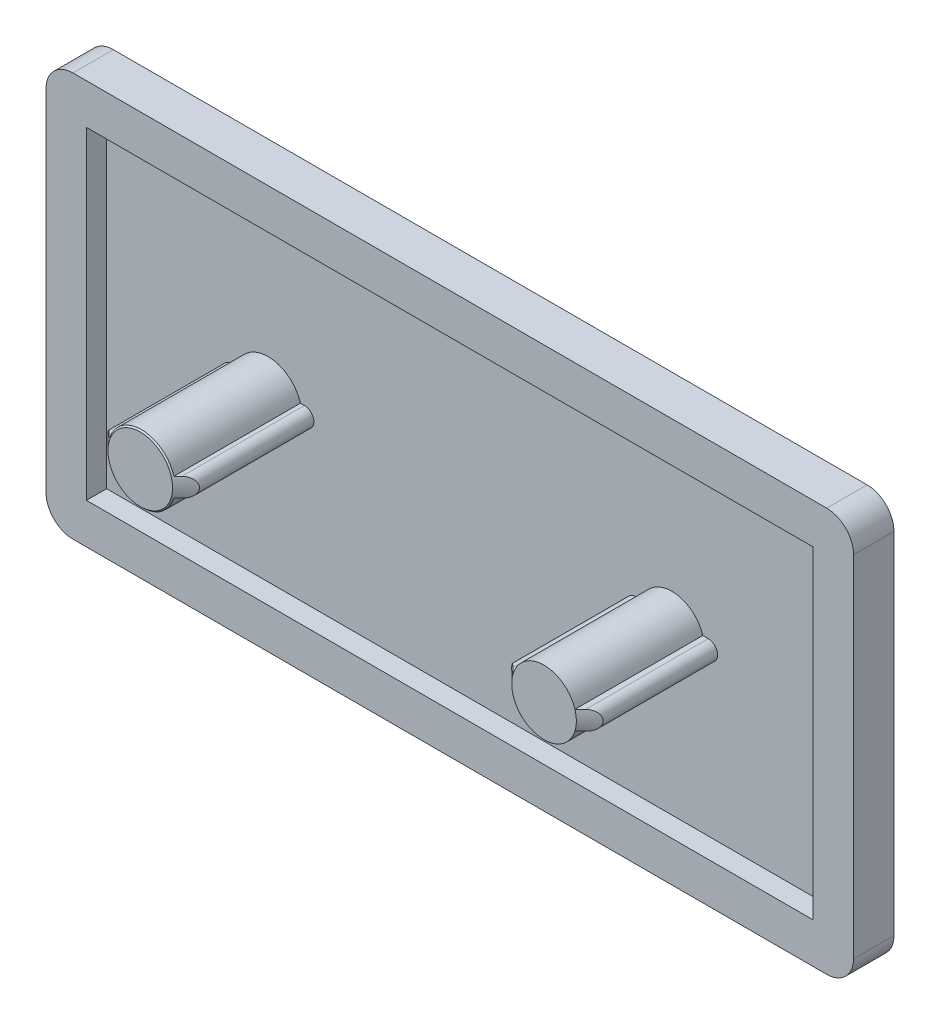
ISO-10303-21;
HEADER;
FILE_DESCRIPTION(('STEP AP214'),'2;1');
FILE_NAME('part.step','',(''),(''),'','','');
FILE_SCHEMA(('AUTOMOTIVE_DESIGN { 1 0 10303 214 1 1 1 1 }'));
ENDSEC;
DATA;
#1=APPLICATION_CONTEXT('core data for automotive mechanical design processes');
#2=APPLICATION_PROTOCOL_DEFINITION('international standard','automotive_design',2000,#1);
#3=PRODUCT_CONTEXT('',#1,'mechanical');
#4=PRODUCT('Part','Part','',(#3));
#5=PRODUCT_RELATED_PRODUCT_CATEGORY('part','',(#4));
#6=PRODUCT_DEFINITION_FORMATION('','',#4);
#7=PRODUCT_DEFINITION_CONTEXT('part definition',#1,'design');
#8=PRODUCT_DEFINITION('design','',#6,#7);
#9=PRODUCT_DEFINITION_SHAPE('','',#8);
#10=(LENGTH_UNIT() NAMED_UNIT(*) SI_UNIT(.MILLI.,.METRE.));
#11=(NAMED_UNIT(*) PLANE_ANGLE_UNIT() SI_UNIT($,.RADIAN.));
#12=(NAMED_UNIT(*) SI_UNIT($,.STERADIAN.) SOLID_ANGLE_UNIT());
#13=UNCERTAINTY_MEASURE_WITH_UNIT(LENGTH_MEASURE(1.E-05),#10,'distance_accuracy_value','');
#14=(GEOMETRIC_REPRESENTATION_CONTEXT(3) GLOBAL_UNCERTAINTY_ASSIGNED_CONTEXT((#13)) GLOBAL_UNIT_ASSIGNED_CONTEXT((#10,
#11,#12)) REPRESENTATION_CONTEXT('',''));
#15=CARTESIAN_POINT('',(0.,0.,0.));
#16=DIRECTION('',(0.,0.,1.));
#17=DIRECTION('',(1.,0.,0.));
#18=AXIS2_PLACEMENT_3D('',#15,#16,#17);
#19=CARTESIAN_POINT('',(-28.,13.,-3.));
#20=DIRECTION('',(0.,0.,1.));
#21=DIRECTION('',(1.,0.,0.));
#22=AXIS2_PLACEMENT_3D('',#19,#20,#21);
#23=CYLINDRICAL_SURFACE('',#22,2.);
#24=CARTESIAN_POINT('',(-28.,13.,0.));
#25=DIRECTION('',(0.,0.,1.));
#26=DIRECTION('',(1.,0.,0.));
#27=AXIS2_PLACEMENT_3D('',#24,#25,#26);
#28=CIRCLE('',#27,2.);
#29=CARTESIAN_POINT('',(-28.,15.,0.));
#30=VERTEX_POINT('',#29);
#31=CARTESIAN_POINT('',(-30.,13.,0.));
#32=VERTEX_POINT('',#31);
#33=EDGE_CURVE('E465',#30,#32,#28,.T.);
#34=ORIENTED_EDGE('',*,*,#33,.F.);
#35=DIRECTION('',(0.,0.,1.));
#36=VECTOR('',#35,1.);
#37=CARTESIAN_POINT('',(-28.,15.,-3.));
#38=LINE('',#37,#36);
#39=CARTESIAN_POINT('',(-28.,15.,-3.));
#40=VERTEX_POINT('',#39);
#41=EDGE_CURVE('E468',#40,#30,#38,.T.);
#42=ORIENTED_EDGE('',*,*,#41,.F.);
#43=CARTESIAN_POINT('',(-28.,13.,-3.));
#44=DIRECTION('',(0.,0.,1.));
#45=DIRECTION('',(1.,0.,0.));
#46=AXIS2_PLACEMENT_3D('',#43,#44,#45);
#47=CIRCLE('',#46,2.);
#48=CARTESIAN_POINT('',(-30.,13.,-3.));
#49=VERTEX_POINT('',#48);
#50=EDGE_CURVE('E484',#40,#49,#47,.T.);
#51=ORIENTED_EDGE('',*,*,#50,.T.);
#52=DIRECTION('',(0.,0.,1.));
#53=VECTOR('',#52,1.);
#54=CARTESIAN_POINT('',(-30.,13.,-3.));
#55=LINE('',#54,#53);
#56=EDGE_CURVE('E470',#49,#32,#55,.T.);
#57=ORIENTED_EDGE('',*,*,#56,.T.);
#58=EDGE_LOOP('',(#34,#42,#51,#57));
#59=FACE_BOUND('',#58,.T.);
#60=ADVANCED_FACE('F16',(#59),#23,.T.);
#61=CARTESIAN_POINT('',(28.,15.,-3.));
#62=DIRECTION('',(0.,1.,0.));
#63=DIRECTION('',(0.,0.,1.));
#64=AXIS2_PLACEMENT_3D('',#61,#62,#63);
#65=PLANE('',#64);
#66=DIRECTION('',(-1.,0.,0.));
#67=VECTOR('',#66,1.);
#68=CARTESIAN_POINT('',(28.,15.,0.));
#69=LINE('',#68,#67);
#70=CARTESIAN_POINT('',(28.,15.,0.));
#71=VERTEX_POINT('',#70);
#72=EDGE_CURVE('E479',#71,#30,#69,.T.);
#73=ORIENTED_EDGE('',*,*,#72,.F.);
#74=DIRECTION('',(0.,0.,1.));
#75=VECTOR('',#74,1.);
#76=CARTESIAN_POINT('',(28.,15.,-3.));
#77=LINE('',#76,#75);
#78=CARTESIAN_POINT('',(28.,15.,-3.));
#79=VERTEX_POINT('',#78);
#80=EDGE_CURVE('E494',#79,#71,#77,.T.);
#81=ORIENTED_EDGE('',*,*,#80,.F.);
#82=DIRECTION('',(-1.,0.,0.));
#83=VECTOR('',#82,1.);
#84=CARTESIAN_POINT('',(28.,15.,-3.));
#85=LINE('',#84,#83);
#86=EDGE_CURVE('E507',#79,#40,#85,.T.);
#87=ORIENTED_EDGE('',*,*,#86,.T.);
#88=ORIENTED_EDGE('',*,*,#41,.T.);
#89=EDGE_LOOP('',(#73,#81,#87,#88));
#90=FACE_BOUND('',#89,.T.);
#91=ADVANCED_FACE('F454',(#90),#65,.T.);
#92=CARTESIAN_POINT('',(28.,13.,-3.));
#93=DIRECTION('',(0.,0.,1.));
#94=DIRECTION('',(1.,0.,0.));
#95=AXIS2_PLACEMENT_3D('',#92,#93,#94);
#96=CYLINDRICAL_SURFACE('',#95,2.);
#97=CARTESIAN_POINT('',(28.,13.,0.));
#98=DIRECTION('',(0.,0.,1.));
#99=DIRECTION('',(1.,0.,0.));
#100=AXIS2_PLACEMENT_3D('',#97,#98,#99);
#101=CIRCLE('',#100,2.);
#102=CARTESIAN_POINT('',(30.,13.,0.));
#103=VERTEX_POINT('',#102);
#104=EDGE_CURVE('E483',#103,#71,#101,.T.);
#105=ORIENTED_EDGE('',*,*,#104,.F.);
#106=DIRECTION('',(0.,0.,1.));
#107=VECTOR('',#106,1.);
#108=CARTESIAN_POINT('',(30.,13.,-3.));
#109=LINE('',#108,#107);
#110=CARTESIAN_POINT('',(30.,13.,-3.));
#111=VERTEX_POINT('',#110);
#112=EDGE_CURVE('E496',#111,#103,#109,.T.);
#113=ORIENTED_EDGE('',*,*,#112,.F.);
#114=CARTESIAN_POINT('',(28.,13.,-3.));
#115=DIRECTION('',(0.,0.,1.));
#116=DIRECTION('',(1.,0.,0.));
#117=AXIS2_PLACEMENT_3D('',#114,#115,#116);
#118=CIRCLE('',#117,2.);
#119=EDGE_CURVE('E624',#111,#79,#118,.T.);
#120=ORIENTED_EDGE('',*,*,#119,.T.);
#121=ORIENTED_EDGE('',*,*,#80,.T.);
#122=EDGE_LOOP('',(#105,#113,#120,#121));
#123=FACE_BOUND('',#122,.T.);
#124=ADVANCED_FACE('F460',(#123),#96,.T.);
#125=CARTESIAN_POINT('',(30.,-13.,-3.));
#126=DIRECTION('',(1.,0.,0.));
#127=DIRECTION('',(0.,0.,-1.));
#128=AXIS2_PLACEMENT_3D('',#125,#126,#127);
#129=PLANE('',#128);
#130=DIRECTION('',(0.,1.,0.));
#131=VECTOR('',#130,1.);
#132=CARTESIAN_POINT('',(30.,-13.,0.));
#133=LINE('',#132,#131);
#134=CARTESIAN_POINT('',(30.,-13.,0.));
#135=VERTEX_POINT('',#134);
#136=EDGE_CURVE('E488',#135,#103,#133,.T.);
#137=ORIENTED_EDGE('',*,*,#136,.F.);
#138=DIRECTION('',(0.,0.,1.));
#139=VECTOR('',#138,1.);
#140=CARTESIAN_POINT('',(30.,-13.,-3.));
#141=LINE('',#140,#139);
#142=CARTESIAN_POINT('',(30.,-13.,-3.));
#143=VERTEX_POINT('',#142);
#144=EDGE_CURVE('E498',#143,#135,#141,.T.);
#145=ORIENTED_EDGE('',*,*,#144,.F.);
#146=DIRECTION('',(0.,1.,0.));
#147=VECTOR('',#146,1.);
#148=CARTESIAN_POINT('',(30.,-13.,-3.));
#149=LINE('',#148,#147);
#150=EDGE_CURVE('E621',#143,#111,#149,.T.);
#151=ORIENTED_EDGE('',*,*,#150,.T.);
#152=ORIENTED_EDGE('',*,*,#112,.T.);
#153=EDGE_LOOP('',(#137,#145,#151,#152));
#154=FACE_BOUND('',#153,.T.);
#155=ADVANCED_FACE('F582',(#154),#129,.T.);
#156=CARTESIAN_POINT('',(28.,-13.,-3.));
#157=DIRECTION('',(0.,0.,1.));
#158=DIRECTION('',(1.,0.,0.));
#159=AXIS2_PLACEMENT_3D('',#156,#157,#158);
#160=CYLINDRICAL_SURFACE('',#159,2.);
#161=CARTESIAN_POINT('',(28.,-13.,0.));
#162=DIRECTION('',(0.,0.,1.));
#163=DIRECTION('',(1.,0.,0.));
#164=AXIS2_PLACEMENT_3D('',#161,#162,#163);
#165=CIRCLE('',#164,2.);
#166=CARTESIAN_POINT('',(28.,-15.,0.));
#167=VERTEX_POINT('',#166);
#168=EDGE_CURVE('E615',#167,#135,#165,.T.);
#169=ORIENTED_EDGE('',*,*,#168,.F.);
#170=DIRECTION('',(0.,0.,1.));
#171=VECTOR('',#170,1.);
#172=CARTESIAN_POINT('',(28.,-15.,-3.));
#173=LINE('',#172,#171);
#174=CARTESIAN_POINT('',(28.,-15.,-3.));
#175=VERTEX_POINT('',#174);
#176=EDGE_CURVE('E500',#175,#167,#173,.T.);
#177=ORIENTED_EDGE('',*,*,#176,.F.);
#178=CARTESIAN_POINT('',(28.,-13.,-3.));
#179=DIRECTION('',(0.,0.,1.));
#180=DIRECTION('',(1.,0.,0.));
#181=AXIS2_PLACEMENT_3D('',#178,#179,#180);
#182=CIRCLE('',#181,2.);
#183=EDGE_CURVE('E630',#175,#143,#182,.T.);
#184=ORIENTED_EDGE('',*,*,#183,.T.);
#185=ORIENTED_EDGE('',*,*,#144,.T.);
#186=EDGE_LOOP('',(#169,#177,#184,#185));
#187=FACE_BOUND('',#186,.T.);
#188=ADVANCED_FACE('F586',(#187),#160,.T.);
#189=CARTESIAN_POINT('',(-28.,-15.,-3.));
#190=DIRECTION('',(0.,-1.,0.));
#191=DIRECTION('',(0.,0.,-1.));
#192=AXIS2_PLACEMENT_3D('',#189,#190,#191);
#193=PLANE('',#192);
#194=DIRECTION('',(1.,0.,0.));
#195=VECTOR('',#194,1.);
#196=CARTESIAN_POINT('',(-28.,-15.,0.));
#197=LINE('',#196,#195);
#198=CARTESIAN_POINT('',(-28.,-15.,0.));
#199=VERTEX_POINT('',#198);
#200=EDGE_CURVE('E609',#199,#167,#197,.T.);
#201=ORIENTED_EDGE('',*,*,#200,.F.);
#202=DIRECTION('',(0.,0.,1.));
#203=VECTOR('',#202,1.);
#204=CARTESIAN_POINT('',(-28.,-15.,-3.));
#205=LINE('',#204,#203);
#206=CARTESIAN_POINT('',(-28.,-15.,-3.));
#207=VERTEX_POINT('',#206);
#208=EDGE_CURVE('E502',#207,#199,#205,.T.);
#209=ORIENTED_EDGE('',*,*,#208,.F.);
#210=DIRECTION('',(1.,0.,0.));
#211=VECTOR('',#210,1.);
#212=CARTESIAN_POINT('',(-28.,-15.,-3.));
#213=LINE('',#212,#211);
#214=EDGE_CURVE('E633',#207,#175,#213,.T.);
#215=ORIENTED_EDGE('',*,*,#214,.T.);
#216=ORIENTED_EDGE('',*,*,#176,.T.);
#217=EDGE_LOOP('',(#201,#209,#215,#216));
#218=FACE_BOUND('',#217,.T.);
#219=ADVANCED_FACE('F590',(#218),#193,.T.);
#220=CARTESIAN_POINT('',(-28.,-13.,-3.));
#221=DIRECTION('',(0.,0.,1.));
#222=DIRECTION('',(1.,0.,0.));
#223=AXIS2_PLACEMENT_3D('',#220,#221,#222);
#224=CYLINDRICAL_SURFACE('',#223,2.);
#225=CARTESIAN_POINT('',(-28.,-13.,0.));
#226=DIRECTION('',(0.,0.,1.));
#227=DIRECTION('',(1.,0.,0.));
#228=AXIS2_PLACEMENT_3D('',#225,#226,#227);
#229=CIRCLE('',#228,2.);
#230=CARTESIAN_POINT('',(-30.,-13.,0.));
#231=VERTEX_POINT('',#230);
#232=EDGE_CURVE('E607',#231,#199,#229,.T.);
#233=ORIENTED_EDGE('',*,*,#232,.F.);
#234=DIRECTION('',(0.,0.,1.));
#235=VECTOR('',#234,1.);
#236=CARTESIAN_POINT('',(-30.,-13.,-3.));
#237=LINE('',#236,#235);
#238=CARTESIAN_POINT('',(-30.,-13.,-3.));
#239=VERTEX_POINT('',#238);
#240=EDGE_CURVE('E504',#239,#231,#237,.T.);
#241=ORIENTED_EDGE('',*,*,#240,.F.);
#242=CARTESIAN_POINT('',(-28.,-13.,-3.));
#243=DIRECTION('',(0.,0.,1.));
#244=DIRECTION('',(1.,0.,0.));
#245=AXIS2_PLACEMENT_3D('',#242,#243,#244);
#246=CIRCLE('',#245,2.);
#247=EDGE_CURVE('E636',#239,#207,#246,.T.);
#248=ORIENTED_EDGE('',*,*,#247,.T.);
#249=ORIENTED_EDGE('',*,*,#208,.T.);
#250=EDGE_LOOP('',(#233,#241,#248,#249));
#251=FACE_BOUND('',#250,.T.);
#252=ADVANCED_FACE('F594',(#251),#224,.T.);
#253=CARTESIAN_POINT('',(-30.,13.,-3.));
#254=DIRECTION('',(-1.,0.,0.));
#255=DIRECTION('',(0.,0.,1.));
#256=AXIS2_PLACEMENT_3D('',#253,#254,#255);
#257=PLANE('',#256);
#258=DIRECTION('',(0.,-1.,0.));
#259=VECTOR('',#258,1.);
#260=CARTESIAN_POINT('',(-30.,13.,0.));
#261=LINE('',#260,#259);
#262=EDGE_CURVE('E474',#32,#231,#261,.T.);
#263=ORIENTED_EDGE('',*,*,#262,.F.);
#264=ORIENTED_EDGE('',*,*,#56,.F.);
#265=DIRECTION('',(0.,-1.,0.));
#266=VECTOR('',#265,1.);
#267=CARTESIAN_POINT('',(-30.,13.,-3.));
#268=LINE('',#267,#266);
#269=EDGE_CURVE('E486',#49,#239,#268,.T.);
#270=ORIENTED_EDGE('',*,*,#269,.T.);
#271=ORIENTED_EDGE('',*,*,#240,.T.);
#272=EDGE_LOOP('',(#263,#264,#270,#271));
#273=FACE_BOUND('',#272,.T.);
#274=ADVANCED_FACE('F575',(#273),#257,.T.);
#275=CARTESIAN_POINT('',(-28.,13.,-3.));
#276=DIRECTION('',(0.,0.,1.));
#277=DIRECTION('',(1.,0.,0.));
#278=AXIS2_PLACEMENT_3D('',#275,#276,#277);
#279=PLANE('',#278);
#280=ORIENTED_EDGE('',*,*,#50,.F.);
#281=ORIENTED_EDGE('',*,*,#86,.F.);
#282=ORIENTED_EDGE('',*,*,#119,.F.);
#283=ORIENTED_EDGE('',*,*,#150,.F.);
#284=ORIENTED_EDGE('',*,*,#183,.F.);
#285=ORIENTED_EDGE('',*,*,#214,.F.);
#286=ORIENTED_EDGE('',*,*,#247,.F.);
#287=ORIENTED_EDGE('',*,*,#269,.F.);
#288=EDGE_LOOP('',(#280,#281,#282,#283,#284,#285,#286,#287));
#289=FACE_BOUND('',#288,.T.);
#290=ADVANCED_FACE('F572',(#289),#279,.F.);
#291=CARTESIAN_POINT('',(-28.,13.,0.));
#292=DIRECTION('',(0.,0.,1.));
#293=DIRECTION('',(1.,0.,0.));
#294=AXIS2_PLACEMENT_3D('',#291,#292,#293);
#295=PLANE('',#294);
#296=DIRECTION('',(0.,-1.,0.));
#297=VECTOR('',#296,1.);
#298=CARTESIAN_POINT('',(-27.,12.,0.));
#299=LINE('',#298,#297);
#300=CARTESIAN_POINT('',(-27.,12.,0.));
#301=VERTEX_POINT('',#300);
#302=CARTESIAN_POINT('',(-27.,-12.,0.));
#303=VERTEX_POINT('',#302);
#304=EDGE_CURVE('E341',#301,#303,#299,.T.);
#305=ORIENTED_EDGE('',*,*,#304,.F.);
#306=DIRECTION('',(-1.,0.,0.));
#307=VECTOR('',#306,1.);
#308=CARTESIAN_POINT('',(27.,12.,0.));
#309=LINE('',#308,#307);
#310=CARTESIAN_POINT('',(27.,12.,0.));
#311=VERTEX_POINT('',#310);
#312=EDGE_CURVE('E649',#311,#301,#309,.T.);
#313=ORIENTED_EDGE('',*,*,#312,.F.);
#314=DIRECTION('',(0.,1.,0.));
#315=VECTOR('',#314,1.);
#316=CARTESIAN_POINT('',(27.,-12.,0.));
#317=LINE('',#316,#315);
#318=CARTESIAN_POINT('',(27.,-12.,0.));
#319=VERTEX_POINT('',#318);
#320=EDGE_CURVE('E653',#319,#311,#317,.T.);
#321=ORIENTED_EDGE('',*,*,#320,.F.);
#322=DIRECTION('',(1.,0.,0.));
#323=VECTOR('',#322,1.);
#324=CARTESIAN_POINT('',(-27.,-12.,0.));
#325=LINE('',#324,#323);
#326=EDGE_CURVE('E656',#303,#319,#325,.T.);
#327=ORIENTED_EDGE('',*,*,#326,.F.);
#328=EDGE_LOOP('',(#305,#313,#321,#327));
#329=FACE_BOUND('',#328,.T.);
#330=ORIENTED_EDGE('',*,*,#33,.T.);
#331=ORIENTED_EDGE('',*,*,#262,.T.);
#332=ORIENTED_EDGE('',*,*,#232,.T.);
#333=ORIENTED_EDGE('',*,*,#200,.T.);
#334=ORIENTED_EDGE('',*,*,#168,.T.);
#335=ORIENTED_EDGE('',*,*,#136,.T.);
#336=ORIENTED_EDGE('',*,*,#104,.T.);
#337=ORIENTED_EDGE('',*,*,#72,.T.);
#338=EDGE_LOOP('',(#330,#331,#332,#333,#334,#335,#336,#337));
#339=FACE_BOUND('',#338,.T.);
#340=ADVANCED_FACE('F480',(#329,#339),#295,.T.);
#341=CARTESIAN_POINT('',(-27.,12.,-1.5));
#342=DIRECTION('',(-1.,0.,0.));
#343=DIRECTION('',(0.,0.,1.));
#344=AXIS2_PLACEMENT_3D('',#341,#342,#343);
#345=PLANE('',#344);
#346=ORIENTED_EDGE('',*,*,#304,.T.);
#347=DIRECTION('',(0.,0.,1.));
#348=VECTOR('',#347,1.);
#349=CARTESIAN_POINT('',(-27.,-12.,-1.5));
#350=LINE('',#349,#348);
#351=CARTESIAN_POINT('',(-27.,-12.,-1.5));
#352=VERTEX_POINT('',#351);
#353=EDGE_CURVE('E640',#352,#303,#350,.T.);
#354=ORIENTED_EDGE('',*,*,#353,.F.);
#355=DIRECTION('',(0.,-1.,0.));
#356=VECTOR('',#355,1.);
#357=CARTESIAN_POINT('',(-27.,12.,-1.5));
#358=LINE('',#357,#356);
#359=CARTESIAN_POINT('',(-27.,12.,-1.5));
#360=VERTEX_POINT('',#359);
#361=EDGE_CURVE('E652',#360,#352,#358,.T.);
#362=ORIENTED_EDGE('',*,*,#361,.F.);
#363=DIRECTION('',(0.,0.,1.));
#364=VECTOR('',#363,1.);
#365=CARTESIAN_POINT('',(-27.,12.,-1.5));
#366=LINE('',#365,#364);
#367=EDGE_CURVE('E475',#360,#301,#366,.T.);
#368=ORIENTED_EDGE('',*,*,#367,.T.);
#369=EDGE_LOOP('',(#346,#354,#362,#368));
#370=FACE_BOUND('',#369,.T.);
#371=ADVANCED_FACE('F561',(#370),#345,.F.);
#372=CARTESIAN_POINT('',(27.,12.,-1.5));
#373=DIRECTION('',(0.,1.,0.));
#374=DIRECTION('',(0.,0.,1.));
#375=AXIS2_PLACEMENT_3D('',#372,#373,#374);
#376=PLANE('',#375);
#377=ORIENTED_EDGE('',*,*,#312,.T.);
#378=ORIENTED_EDGE('',*,*,#367,.F.);
#379=DIRECTION('',(-1.,0.,0.));
#380=VECTOR('',#379,1.);
#381=CARTESIAN_POINT('',(27.,12.,-1.5));
#382=LINE('',#381,#380);
#383=CARTESIAN_POINT('',(27.,12.,-1.5));
#384=VERTEX_POINT('',#383);
#385=EDGE_CURVE('E644',#384,#360,#382,.T.);
#386=ORIENTED_EDGE('',*,*,#385,.F.);
#387=DIRECTION('',(0.,0.,1.));
#388=VECTOR('',#387,1.);
#389=CARTESIAN_POINT('',(27.,12.,-1.5));
#390=LINE('',#389,#388);
#391=EDGE_CURVE('E646',#384,#311,#390,.T.);
#392=ORIENTED_EDGE('',*,*,#391,.T.);
#393=EDGE_LOOP('',(#377,#378,#386,#392));
#394=FACE_BOUND('',#393,.T.);
#395=ADVANCED_FACE('F557',(#394),#376,.F.);
#396=CARTESIAN_POINT('',(27.,-12.,-1.5));
#397=DIRECTION('',(1.,0.,0.));
#398=DIRECTION('',(0.,0.,-1.));
#399=AXIS2_PLACEMENT_3D('',#396,#397,#398);
#400=PLANE('',#399);
#401=ORIENTED_EDGE('',*,*,#320,.T.);
#402=ORIENTED_EDGE('',*,*,#391,.F.);
#403=DIRECTION('',(0.,1.,0.));
#404=VECTOR('',#403,1.);
#405=CARTESIAN_POINT('',(27.,-12.,-1.5));
#406=LINE('',#405,#404);
#407=CARTESIAN_POINT('',(27.,-12.,-1.5));
#408=VERTEX_POINT('',#407);
#409=EDGE_CURVE('E662',#408,#384,#406,.T.);
#410=ORIENTED_EDGE('',*,*,#409,.F.);
#411=DIRECTION('',(0.,0.,1.));
#412=VECTOR('',#411,1.);
#413=CARTESIAN_POINT('',(27.,-12.,-1.5));
#414=LINE('',#413,#412);
#415=EDGE_CURVE('E643',#408,#319,#414,.T.);
#416=ORIENTED_EDGE('',*,*,#415,.T.);
#417=EDGE_LOOP('',(#401,#402,#410,#416));
#418=FACE_BOUND('',#417,.T.);
#419=ADVANCED_FACE('F560',(#418),#400,.F.);
#420=CARTESIAN_POINT('',(-27.,-12.,-1.5));
#421=DIRECTION('',(0.,-1.,0.));
#422=DIRECTION('',(0.,0.,-1.));
#423=AXIS2_PLACEMENT_3D('',#420,#421,#422);
#424=PLANE('',#423);
#425=ORIENTED_EDGE('',*,*,#326,.T.);
#426=ORIENTED_EDGE('',*,*,#415,.F.);
#427=DIRECTION('',(1.,0.,0.));
#428=VECTOR('',#427,1.);
#429=CARTESIAN_POINT('',(-27.,-12.,-1.5));
#430=LINE('',#429,#428);
#431=EDGE_CURVE('E665',#352,#408,#430,.T.);
#432=ORIENTED_EDGE('',*,*,#431,.F.);
#433=ORIENTED_EDGE('',*,*,#353,.T.);
#434=EDGE_LOOP('',(#425,#426,#432,#433));
#435=FACE_BOUND('',#434,.T.);
#436=ADVANCED_FACE('F555',(#435),#424,.F.);
#437=CARTESIAN_POINT('',(0.,0.,-1.5));
#438=DIRECTION('',(0.,0.,1.));
#439=DIRECTION('',(1.,0.,0.));
#440=AXIS2_PLACEMENT_3D('',#437,#438,#439);
#441=PLANE('',#440);
#442=ORIENTED_EDGE('',*,*,#361,.T.);
#443=ORIENTED_EDGE('',*,*,#431,.T.);
#444=ORIENTED_EDGE('',*,*,#409,.T.);
#445=ORIENTED_EDGE('',*,*,#385,.T.);
#446=EDGE_LOOP('',(#442,#443,#444,#445));
#447=FACE_BOUND('',#446,.T.);
#448=DIRECTION('',(1.,0.,0.));
#449=VECTOR('',#448,1.);
#450=CARTESIAN_POINT('',(-17.7,-0.7,-1.5));
#451=LINE('',#450,#449);
#452=CARTESIAN_POINT('',(-17.7,-0.7,-1.5));
#453=VERTEX_POINT('',#452);
#454=CARTESIAN_POINT('',(-17.4,-0.7,-1.5));
#455=VERTEX_POINT('',#454);
#456=EDGE_CURVE('E346',#453,#455,#451,.T.);
#457=ORIENTED_EDGE('',*,*,#456,.F.);
#458=CARTESIAN_POINT('',(-17.7,0.,-1.5));
#459=DIRECTION('',(0.,0.,1.));
#460=DIRECTION('',(1.,0.,0.));
#461=AXIS2_PLACEMENT_3D('',#458,#459,#460);
#462=CIRCLE('',#461,0.7);
#463=CARTESIAN_POINT('',(-17.7,0.7,-1.5));
#464=VERTEX_POINT('',#463);
#465=EDGE_CURVE('E345',#464,#453,#462,.T.);
#466=ORIENTED_EDGE('',*,*,#465,.F.);
#467=DIRECTION('',(-1.,0.,0.));
#468=VECTOR('',#467,1.);
#469=CARTESIAN_POINT('',(-17.4,0.7,-1.5));
#470=LINE('',#469,#468);
#471=CARTESIAN_POINT('',(-17.4,0.7,-1.5));
#472=VERTEX_POINT('',#471);
#473=EDGE_CURVE('E369',#472,#464,#470,.T.);
#474=ORIENTED_EDGE('',*,*,#473,.F.);
#475=CARTESIAN_POINT('',(-15.,0.,-1.5));
#476=DIRECTION('',(0.,0.,1.));
#477=DIRECTION('',(1.,0.,0.));
#478=AXIS2_PLACEMENT_3D('',#475,#476,#477);
#479=CIRCLE('',#478,2.5);
#480=CARTESIAN_POINT('',(-12.6,0.7,-1.5));
#481=VERTEX_POINT('',#480);
#482=EDGE_CURVE('E366',#481,#472,#479,.T.);
#483=ORIENTED_EDGE('',*,*,#482,.F.);
#484=DIRECTION('',(-1.,0.,0.));
#485=VECTOR('',#484,1.);
#486=CARTESIAN_POINT('',(-12.3,0.7,-1.5));
#487=LINE('',#486,#485);
#488=CARTESIAN_POINT('',(-12.3,0.7,-1.5));
#489=VERTEX_POINT('',#488);
#490=EDGE_CURVE('E363',#489,#481,#487,.T.);
#491=ORIENTED_EDGE('',*,*,#490,.F.);
#492=CARTESIAN_POINT('',(-12.3,0.,-1.5));
#493=DIRECTION('',(0.,0.,1.));
#494=DIRECTION('',(1.,0.,0.));
#495=AXIS2_PLACEMENT_3D('',#492,#493,#494);
#496=CIRCLE('',#495,0.7);
#497=CARTESIAN_POINT('',(-12.3,-0.7,-1.5));
#498=VERTEX_POINT('',#497);
#499=EDGE_CURVE('E360',#498,#489,#496,.T.);
#500=ORIENTED_EDGE('',*,*,#499,.F.);
#501=DIRECTION('',(1.,0.,0.));
#502=VECTOR('',#501,1.);
#503=CARTESIAN_POINT('',(-12.6,-0.7,-1.5));
#504=LINE('',#503,#502);
#505=CARTESIAN_POINT('',(-12.6,-0.7,-1.5));
#506=VERTEX_POINT('',#505);
#507=EDGE_CURVE('E357',#506,#498,#504,.T.);
#508=ORIENTED_EDGE('',*,*,#507,.F.);
#509=CARTESIAN_POINT('',(-15.,0.,-1.5));
#510=DIRECTION('',(0.,0.,1.));
#511=DIRECTION('',(1.,0.,0.));
#512=AXIS2_PLACEMENT_3D('',#509,#510,#511);
#513=CIRCLE('',#512,2.5);
#514=EDGE_CURVE('E352',#455,#506,#513,.T.);
#515=ORIENTED_EDGE('',*,*,#514,.F.);
#516=EDGE_LOOP('',(#457,#466,#474,#483,#491,#500,#508,#515));
#517=FACE_BOUND('',#516,.T.);
#518=DIRECTION('',(1.,0.,0.));
#519=VECTOR('',#518,1.);
#520=CARTESIAN_POINT('',(12.3,-0.7,-1.5));
#521=LINE('',#520,#519);
#522=CARTESIAN_POINT('',(12.3,-0.7,-1.5));
#523=VERTEX_POINT('',#522);
#524=CARTESIAN_POINT('',(12.7043519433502,-0.7,-1.5));
#525=VERTEX_POINT('',#524);
#526=EDGE_CURVE('E213',#523,#525,#521,.T.);
#527=ORIENTED_EDGE('',*,*,#526,.F.);
#528=CARTESIAN_POINT('',(12.3,0.,-1.5));
#529=DIRECTION('',(0.,0.,1.));
#530=DIRECTION('',(1.,0.,0.));
#531=AXIS2_PLACEMENT_3D('',#528,#529,#530);
#532=CIRCLE('',#531,0.7);
#533=CARTESIAN_POINT('',(12.3,0.7,-1.5));
#534=VERTEX_POINT('',#533);
#535=EDGE_CURVE('E206',#534,#523,#532,.T.);
#536=ORIENTED_EDGE('',*,*,#535,.F.);
#537=DIRECTION('',(-1.,0.,0.));
#538=VECTOR('',#537,1.);
#539=CARTESIAN_POINT('',(12.7043519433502,0.7,-1.5));
#540=LINE('',#539,#538);
#541=CARTESIAN_POINT('',(12.7043519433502,0.7,-1.5));
#542=VERTEX_POINT('',#541);
#543=EDGE_CURVE('E245',#542,#534,#540,.T.);
#544=ORIENTED_EDGE('',*,*,#543,.F.);
#545=CARTESIAN_POINT('',(15.,0.,-1.5));
#546=DIRECTION('',(0.,0.,1.));
#547=DIRECTION('',(1.,0.,0.));
#548=AXIS2_PLACEMENT_3D('',#545,#546,#547);
#549=CIRCLE('',#548,2.4);
#550=CARTESIAN_POINT('',(17.2956480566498,0.7,-1.5));
#551=VERTEX_POINT('',#550);
#552=EDGE_CURVE('E242',#551,#542,#549,.T.);
#553=ORIENTED_EDGE('',*,*,#552,.F.);
#554=DIRECTION('',(-1.,0.,0.));
#555=VECTOR('',#554,1.);
#556=CARTESIAN_POINT('',(17.7,0.7,-1.5));
#557=LINE('',#556,#555);
#558=CARTESIAN_POINT('',(17.7,0.7,-1.5));
#559=VERTEX_POINT('',#558);
#560=EDGE_CURVE('E239',#559,#551,#557,.T.);
#561=ORIENTED_EDGE('',*,*,#560,.F.);
#562=CARTESIAN_POINT('',(17.7,0.,-1.5));
#563=DIRECTION('',(0.,0.,1.));
#564=DIRECTION('',(1.,0.,0.));
#565=AXIS2_PLACEMENT_3D('',#562,#563,#564);
#566=CIRCLE('',#565,0.7);
#567=CARTESIAN_POINT('',(17.7,-0.7,-1.5));
#568=VERTEX_POINT('',#567);
#569=EDGE_CURVE('E236',#568,#559,#566,.T.);
#570=ORIENTED_EDGE('',*,*,#569,.F.);
#571=DIRECTION('',(1.,0.,0.));
#572=VECTOR('',#571,1.);
#573=CARTESIAN_POINT('',(17.2956480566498,-0.7,-1.5));
#574=LINE('',#573,#572);
#575=CARTESIAN_POINT('',(17.2956480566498,-0.7,-1.5));
#576=VERTEX_POINT('',#575);
#577=EDGE_CURVE('E231',#576,#568,#574,.T.);
#578=ORIENTED_EDGE('',*,*,#577,.F.);
#579=CARTESIAN_POINT('',(15.,0.,-1.5));
#580=DIRECTION('',(0.,0.,1.));
#581=DIRECTION('',(1.,0.,0.));
#582=AXIS2_PLACEMENT_3D('',#579,#580,#581);
#583=CIRCLE('',#582,2.4);
#584=EDGE_CURVE('E229',#525,#576,#583,.T.);
#585=ORIENTED_EDGE('',*,*,#584,.F.);
#586=EDGE_LOOP('',(#527,#536,#544,#553,#561,#570,#578,#585));
#587=FACE_BOUND('',#586,.T.);
#588=ADVANCED_FACE('F226',(#447,#517,#587),#441,.T.);
#589=CARTESIAN_POINT('',(-17.7,-0.7,8.5));
#590=DIRECTION('',(0.,1.,0.));
#591=DIRECTION('',(0.,0.,1.));
#592=AXIS2_PLACEMENT_3D('',#589,#590,#591);
#593=PLANE('',#592);
#594=DIRECTION('',(0.,0.,-1.));
#595=VECTOR('',#594,1.);
#596=CARTESIAN_POINT('',(-17.7,-0.7,8.5));
#597=LINE('',#596,#595);
#598=CARTESIAN_POINT('',(-17.7,-0.7,7.61073486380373));
#599=VERTEX_POINT('',#598);
#600=EDGE_CURVE('E385',#599,#453,#597,.T.);
#601=ORIENTED_EDGE('',*,*,#600,.T.);
#602=ORIENTED_EDGE('',*,*,#456,.T.);
#603=DIRECTION('',(0.,0.,-1.));
#604=VECTOR('',#603,1.);
#605=CARTESIAN_POINT('',(-17.4,-0.7,8.5));
#606=LINE('',#605,#604);
#607=CARTESIAN_POINT('',(-17.4,-0.7,7.9));
#608=VERTEX_POINT('',#607);
#609=EDGE_CURVE('E383',#608,#455,#606,.T.);
#610=ORIENTED_EDGE('',*,*,#609,.F.);
#611=CARTESIAN_POINT('',(-19.0542729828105,-0.7,6.28574072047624));
#612=CARTESIAN_POINT('',(-18.9348010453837,-0.7,6.40346299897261));
#613=CARTESIAN_POINT('',(-18.8152610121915,-0.7,6.52111639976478));
#614=CARTESIAN_POINT('',(-18.5759839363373,-0.7,6.75621772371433));
#615=CARTESIAN_POINT('',(-18.4562468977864,-0.7,6.87366565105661));
#616=CARTESIAN_POINT('',(-18.2165306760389,-0.7,7.10827300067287));
#617=CARTESIAN_POINT('',(-18.0965515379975,-0.7,7.22543246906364));
#618=CARTESIAN_POINT('',(-17.8562242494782,-0.7,7.45937827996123));
#619=CARTESIAN_POINT('',(-17.7358760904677,-0.7,7.57616461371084));
#620=CARTESIAN_POINT('',(-17.4946185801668,-0.7,7.80921864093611));
#621=CARTESIAN_POINT('',(-17.3737090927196,-0.7,7.92548619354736));
#622=CARTESIAN_POINT('',(-17.1310946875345,-0.7,8.15717800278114));
#623=CARTESIAN_POINT('',(-17.0093898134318,-0.7,8.27260230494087));
#624=CARTESIAN_POINT('',(-16.8258285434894,-0.7,8.44469851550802));
#625=CARTESIAN_POINT('',(-16.7644666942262,-0.7,8.5018973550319));
#626=CARTESIAN_POINT('',(-16.64130066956,-0.7,8.61581377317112));
#627=CARTESIAN_POINT('',(-16.5794965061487,-0.7,8.6725313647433));
#628=CARTESIAN_POINT('',(-16.4552849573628,-0.7,8.7853288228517));
#629=CARTESIAN_POINT('',(-16.3928774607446,-0.7,8.84140856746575));
#630=CARTESIAN_POINT('',(-16.2671959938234,-0.7,8.95259895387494));
#631=CARTESIAN_POINT('',(-16.2039219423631,-0.7,9.00770950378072));
#632=CARTESIAN_POINT('',(-16.1400831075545,-0.7,9.06216985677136));
#633=B_SPLINE_CURVE_WITH_KNOTS('',3,(#611,#612,#613,#614,#615,#616,#617,#618,#619,#620,#621,
#622,#623,#624,#625,#626,#627,#628,#629,#630,#631,#632),.UNSPECIFIED.,.F.,.F.,(4,2,2,2,2,2,2,2,
2,2,4),(0.,0.503178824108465,1.00634727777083,1.50942925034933,2.01252294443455,2.5157458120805,
3.01894130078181,3.27059952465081,3.5222509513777,3.77394969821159,4.02567218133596),.UNSPECIFIED.);
#634=EDGE_CURVE('E434',#599,#608,#633,.T.);
#635=ORIENTED_EDGE('',*,*,#634,.F.);
#636=EDGE_LOOP('',(#601,#602,#610,#635));
#637=FACE_BOUND('',#636,.T.);
#638=ADVANCED_FACE('F440',(#637),#593,.F.);
#639=CARTESIAN_POINT('',(-15.,0.,8.5));
#640=DIRECTION('',(0.,0.,-1.));
#641=DIRECTION('',(-1.,0.,0.));
#642=AXIS2_PLACEMENT_3D('',#639,#640,#641);
#643=CYLINDRICAL_SURFACE('',#642,2.5);
#644=ORIENTED_EDGE('',*,*,#609,.T.);
#645=ORIENTED_EDGE('',*,*,#514,.T.);
#646=DIRECTION('',(0.,0.,-1.));
#647=VECTOR('',#646,1.);
#648=CARTESIAN_POINT('',(-12.6,-0.7,8.5));
#649=LINE('',#648,#647);
#650=CARTESIAN_POINT('',(-12.6,-0.7,7.9));
#651=VERTEX_POINT('',#650);
#652=EDGE_CURVE('E381',#651,#506,#649,.T.);
#653=ORIENTED_EDGE('',*,*,#652,.F.);
#654=CARTESIAN_POINT('',(-15.,0.,7.9));
#655=DIRECTION('',(0.,0.,-1.));
#656=DIRECTION('',(-1.,0.,0.));
#657=AXIS2_PLACEMENT_3D('',#654,#655,#656);
#658=CIRCLE('',#657,2.5);
#659=EDGE_CURVE('E426',#608,#651,#658,.F.);
#660=ORIENTED_EDGE('',*,*,#659,.F.);
#661=EDGE_LOOP('',(#644,#645,#653,#660));
#662=FACE_BOUND('',#661,.T.);
#663=ADVANCED_FACE('F414',(#662),#643,.T.);
#664=CARTESIAN_POINT('',(-12.6,-0.7,8.5));
#665=DIRECTION('',(0.,1.,0.));
#666=DIRECTION('',(0.,0.,1.));
#667=AXIS2_PLACEMENT_3D('',#664,#665,#666);
#668=PLANE('',#667);
#669=ORIENTED_EDGE('',*,*,#652,.T.);
#670=ORIENTED_EDGE('',*,*,#507,.T.);
#671=DIRECTION('',(0.,0.,-1.));
#672=VECTOR('',#671,1.);
#673=CARTESIAN_POINT('',(-12.3,-0.7,8.5));
#674=LINE('',#673,#672);
#675=CARTESIAN_POINT('',(-12.3,-0.7,7.61073486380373));
#676=VERTEX_POINT('',#675);
#677=EDGE_CURVE('E378',#676,#498,#674,.T.);
#678=ORIENTED_EDGE('',*,*,#677,.F.);
#679=CARTESIAN_POINT('',(-13.8599168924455,-0.7,9.06216985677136));
#680=CARTESIAN_POINT('',(-13.8101667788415,-0.7,9.01974932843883));
#681=CARTESIAN_POINT('',(-13.760770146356,-0.7,8.97691958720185));
#682=CARTESIAN_POINT('',(-13.662542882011,-0.7,8.89062141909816));
#683=CARTESIAN_POINT('',(-13.6137122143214,-0.7,8.84715303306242));
#684=CARTESIAN_POINT('',(-13.5164766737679,-0.7,8.75975820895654));
#685=CARTESIAN_POINT('',(-13.4680717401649,-0.7,8.71583183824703));
#686=CARTESIAN_POINT('',(-13.3715902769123,-0.7,8.62761841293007));
#687=CARTESIAN_POINT('',(-13.3235137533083,-0.7,8.58333135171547));
#688=CARTESIAN_POINT('',(-13.1796925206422,-0.7,8.45007430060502));
#689=CARTESIAN_POINT('',(-13.0843336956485,-0.7,8.36068811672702));
#690=CARTESIAN_POINT('',(-12.894286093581,-0.7,8.18120211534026));
#691=CARTESIAN_POINT('',(-12.7995973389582,-0.7,8.09110227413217));
#692=CARTESIAN_POINT('',(-12.6516087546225,-0.7,7.94955111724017));
#693=CARTESIAN_POINT('',(-12.598149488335,-0.7,7.89826631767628));
#694=CARTESIAN_POINT('',(-12.491355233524,-0.7,7.79556448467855));
#695=CARTESIAN_POINT('',(-12.4380202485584,-0.7,7.74414744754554));
#696=CARTESIAN_POINT('',(-12.2641072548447,-0.7,7.57614966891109));
#697=CARTESIAN_POINT('',(-12.1437434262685,-0.7,7.45934722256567));
#698=CARTESIAN_POINT('',(-11.903381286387,-0.7,7.22536666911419));
#699=CARTESIAN_POINT('',(-11.7833829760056,-0.7,7.10818856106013));
#700=CARTESIAN_POINT('',(-11.5436636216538,-0.7,6.87357800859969));
#701=CARTESIAN_POINT('',(-11.4239425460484,-0.7,6.75614559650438));
#702=CARTESIAN_POINT('',(-11.1847006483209,-0.7,6.52107862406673));
#703=CARTESIAN_POINT('',(-11.0651798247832,-0.7,6.40344406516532));
#704=CARTESIAN_POINT('',(-10.9457270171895,-0.7,6.28574072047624));
#705=B_SPLINE_CURVE_WITH_KNOTS('',3,(#679,#680,#681,#682,#683,#684,#685,#686,#687,#688,#689,
#690,#691,#692,#693,#694,#695,#696,#697,#698,#699,#700,#701,#702,#703,#704),.UNSPECIFIED.,.F.,
.F.,(4,2,2,2,2,2,2,2,2,2,2,2,4),(0.,0.196133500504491,0.392254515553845,0.588347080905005,
0.784443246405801,1.1765447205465,1.56865927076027,1.79090264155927,2.0131522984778,
2.51631325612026,3.01947548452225,3.52257714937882,4.02567524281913),.UNSPECIFIED.);
#706=EDGE_CURVE('E418',#651,#676,#705,.T.);
#707=ORIENTED_EDGE('',*,*,#706,.F.);
#708=EDGE_LOOP('',(#669,#670,#678,#707));
#709=FACE_BOUND('',#708,.T.);
#710=ADVANCED_FACE('F410',(#709),#668,.F.);
#711=CARTESIAN_POINT('',(-12.3,0.7,8.5));
#712=DIRECTION('',(0.,-1.,0.));
#713=DIRECTION('',(0.,0.,-1.));
#714=AXIS2_PLACEMENT_3D('',#711,#712,#713);
#715=PLANE('',#714);
#716=DIRECTION('',(0.,0.,-1.));
#717=VECTOR('',#716,1.);
#718=CARTESIAN_POINT('',(-12.3,0.7,8.5));
#719=LINE('',#718,#717);
#720=CARTESIAN_POINT('',(-12.3,0.7,7.61073486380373));
#721=VERTEX_POINT('',#720);
#722=EDGE_CURVE('E376',#721,#489,#719,.T.);
#723=ORIENTED_EDGE('',*,*,#722,.T.);
#724=ORIENTED_EDGE('',*,*,#490,.T.);
#725=DIRECTION('',(0.,0.,-1.));
#726=VECTOR('',#725,1.);
#727=CARTESIAN_POINT('',(-12.6,0.7,8.5));
#728=LINE('',#727,#726);
#729=CARTESIAN_POINT('',(-12.6,0.7,7.9));
#730=VERTEX_POINT('',#729);
#731=EDGE_CURVE('E374',#730,#481,#728,.T.);
#732=ORIENTED_EDGE('',*,*,#731,.F.);
#733=CARTESIAN_POINT('',(-10.9457270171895,0.7,6.28574072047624));
#734=CARTESIAN_POINT('',(-11.0651989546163,0.7,6.40346299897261));
#735=CARTESIAN_POINT('',(-11.1847389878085,0.7,6.52111639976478));
#736=CARTESIAN_POINT('',(-11.4240160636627,0.7,6.75621772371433));
#737=CARTESIAN_POINT('',(-11.5437531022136,0.7,6.87366565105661));
#738=CARTESIAN_POINT('',(-11.7834693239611,0.7,7.10827300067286));
#739=CARTESIAN_POINT('',(-11.9034484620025,0.7,7.22543246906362));
#740=CARTESIAN_POINT('',(-12.1437757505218,0.7,7.45937827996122));
#741=CARTESIAN_POINT('',(-12.2641239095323,0.7,7.57616461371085));
#742=CARTESIAN_POINT('',(-12.5053814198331,0.7,7.80921864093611));
#743=CARTESIAN_POINT('',(-12.6262909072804,0.7,7.92548619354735));
#744=CARTESIAN_POINT('',(-12.8689053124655,0.7,8.15717800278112));
#745=CARTESIAN_POINT('',(-12.9906101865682,0.7,8.27260230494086));
#746=CARTESIAN_POINT('',(-13.1741714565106,0.7,8.44469851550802));
#747=CARTESIAN_POINT('',(-13.2355333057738,0.7,8.5018973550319));
#748=CARTESIAN_POINT('',(-13.35869933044,0.7,8.61581377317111));
#749=CARTESIAN_POINT('',(-13.4205034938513,0.7,8.67253136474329));
#750=CARTESIAN_POINT('',(-13.5447150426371,0.7,8.7853288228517));
#751=CARTESIAN_POINT('',(-13.6071225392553,0.7,8.84140856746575));
#752=CARTESIAN_POINT('',(-13.7328040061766,0.7,8.95259895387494));
#753=CARTESIAN_POINT('',(-13.7960780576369,0.7,9.00770950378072));
#754=CARTESIAN_POINT('',(-13.8599168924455,0.7,9.06216985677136));
#755=B_SPLINE_CURVE_WITH_KNOTS('',3,(#733,#734,#735,#736,#737,#738,#739,#740,#741,#742,#743,
#744,#745,#746,#747,#748,#749,#750,#751,#752,#753,#754),.UNSPECIFIED.,.F.,.F.,(4,2,2,2,2,2,2,2,
2,2,4),(0.,0.50317882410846,1.00634727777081,1.50942925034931,2.01252294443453,2.51574581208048,
3.01894130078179,3.2705995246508,3.52225095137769,3.77394969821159,4.02567218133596),.UNSPECIFIED.);
#756=EDGE_CURVE('E427',#721,#730,#755,.T.);
#757=ORIENTED_EDGE('',*,*,#756,.F.);
#758=EDGE_LOOP('',(#723,#724,#732,#757));
#759=FACE_BOUND('',#758,.T.);
#760=ADVANCED_FACE('F407',(#759),#715,.F.);
#761=CARTESIAN_POINT('',(-15.,0.,8.5));
#762=DIRECTION('',(0.,0.,-1.));
#763=DIRECTION('',(-1.,0.,0.));
#764=AXIS2_PLACEMENT_3D('',#761,#762,#763);
#765=CYLINDRICAL_SURFACE('',#764,2.5);
#766=ORIENTED_EDGE('',*,*,#731,.T.);
#767=ORIENTED_EDGE('',*,*,#482,.T.);
#768=DIRECTION('',(0.,0.,-1.));
#769=VECTOR('',#768,1.);
#770=CARTESIAN_POINT('',(-17.4,0.7,8.5));
#771=LINE('',#770,#769);
#772=CARTESIAN_POINT('',(-17.4,0.7,7.9));
#773=VERTEX_POINT('',#772);
#774=EDGE_CURVE('E372',#773,#472,#771,.T.);
#775=ORIENTED_EDGE('',*,*,#774,.F.);
#776=CARTESIAN_POINT('',(-15.,0.,7.9));
#777=DIRECTION('',(0.,0.,-1.));
#778=DIRECTION('',(-1.,0.,0.));
#779=AXIS2_PLACEMENT_3D('',#776,#777,#778);
#780=CIRCLE('',#779,2.5);
#781=EDGE_CURVE('E513',#730,#773,#780,.F.);
#782=ORIENTED_EDGE('',*,*,#781,.F.);
#783=EDGE_LOOP('',(#766,#767,#775,#782));
#784=FACE_BOUND('',#783,.T.);
#785=ADVANCED_FACE('F452',(#784),#765,.T.);
#786=CARTESIAN_POINT('',(-17.4,0.7,8.5));
#787=DIRECTION('',(0.,-1.,0.));
#788=DIRECTION('',(0.,0.,-1.));
#789=AXIS2_PLACEMENT_3D('',#786,#787,#788);
#790=PLANE('',#789);
#791=ORIENTED_EDGE('',*,*,#774,.T.);
#792=ORIENTED_EDGE('',*,*,#473,.T.);
#793=DIRECTION('',(0.,0.,-1.));
#794=VECTOR('',#793,1.);
#795=CARTESIAN_POINT('',(-17.7,0.7,8.5));
#796=LINE('',#795,#794);
#797=CARTESIAN_POINT('',(-17.7,0.7,7.61073486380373));
#798=VERTEX_POINT('',#797);
#799=EDGE_CURVE('E44',#798,#464,#796,.T.);
#800=ORIENTED_EDGE('',*,*,#799,.F.);
#801=CARTESIAN_POINT('',(-16.1400831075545,0.7,9.06216985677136));
#802=CARTESIAN_POINT('',(-16.1898332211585,0.7,9.01974932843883));
#803=CARTESIAN_POINT('',(-16.239229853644,0.7,8.97691958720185));
#804=CARTESIAN_POINT('',(-16.337457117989,0.7,8.89062141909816));
#805=CARTESIAN_POINT('',(-16.3862877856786,0.7,8.84715303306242));
#806=CARTESIAN_POINT('',(-16.4835233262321,0.7,8.75975820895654));
#807=CARTESIAN_POINT('',(-16.5319282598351,0.7,8.71583183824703));
#808=CARTESIAN_POINT('',(-16.6284097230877,0.7,8.62761841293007));
#809=CARTESIAN_POINT('',(-16.6764862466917,0.7,8.58333135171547));
#810=CARTESIAN_POINT('',(-16.8203074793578,0.7,8.45007430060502));
#811=CARTESIAN_POINT('',(-16.9156663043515,0.7,8.36068811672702));
#812=CARTESIAN_POINT('',(-17.105713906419,0.7,8.18120211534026));
#813=CARTESIAN_POINT('',(-17.2004026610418,0.7,8.09110227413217));
#814=CARTESIAN_POINT('',(-17.3483912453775,0.7,7.94955111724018));
#815=CARTESIAN_POINT('',(-17.401850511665,0.7,7.89826631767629));
#816=CARTESIAN_POINT('',(-17.508644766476,0.7,7.79556448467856));
#817=CARTESIAN_POINT('',(-17.5619797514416,0.7,7.74414744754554));
#818=CARTESIAN_POINT('',(-17.7358927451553,0.7,7.57614966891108));
#819=CARTESIAN_POINT('',(-17.8562565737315,0.7,7.45934722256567));
#820=CARTESIAN_POINT('',(-18.096618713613,0.7,7.2253666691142));
#821=CARTESIAN_POINT('',(-18.2166170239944,0.7,7.10818856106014));
#822=CARTESIAN_POINT('',(-18.4563363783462,0.7,6.87357800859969));
#823=CARTESIAN_POINT('',(-18.5760574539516,0.7,6.75614559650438));
#824=CARTESIAN_POINT('',(-18.8152993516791,0.7,6.52107862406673));
#825=CARTESIAN_POINT('',(-18.9348201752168,0.7,6.40344406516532));
#826=CARTESIAN_POINT('',(-19.0542729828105,0.7,6.28574072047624));
#827=B_SPLINE_CURVE_WITH_KNOTS('',3,(#801,#802,#803,#804,#805,#806,#807,#808,#809,#810,#811,
#812,#813,#814,#815,#816,#817,#818,#819,#820,#821,#822,#823,#824,#825,#826),.UNSPECIFIED.,.F.,
.F.,(4,2,2,2,2,2,2,2,2,2,2,2,4),(0.,0.19613350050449,0.392254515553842,0.588347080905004,
0.784443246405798,1.1765447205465,1.56865927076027,1.79090264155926,2.01315229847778,
2.51631325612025,3.01947548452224,3.52257714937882,4.02567524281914),.UNSPECIFIED.);
#828=EDGE_CURVE('E493',#773,#798,#827,.T.);
#829=ORIENTED_EDGE('',*,*,#828,.F.);
#830=EDGE_LOOP('',(#791,#792,#800,#829));
#831=FACE_BOUND('',#830,.T.);
#832=ADVANCED_FACE('F446',(#831),#790,.F.);
#833=CARTESIAN_POINT('',(-17.7,0.,8.5));
#834=DIRECTION('',(0.,0.,-1.));
#835=DIRECTION('',(-1.,0.,0.));
#836=AXIS2_PLACEMENT_3D('',#833,#834,#835);
#837=CYLINDRICAL_SURFACE('',#836,0.7);
#838=ORIENTED_EDGE('',*,*,#799,.T.);
#839=ORIENTED_EDGE('',*,*,#465,.T.);
#840=ORIENTED_EDGE('',*,*,#600,.F.);
#841=CARTESIAN_POINT('',(-17.6998,0.69999997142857,7.61092846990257));
#842=CARTESIAN_POINT('',(-17.7420256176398,0.699991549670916,7.57002643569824));
#843=CARTESIAN_POINT('',(-17.7848268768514,0.696194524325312,7.5295161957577));
#844=CARTESIAN_POINT('',(-17.8707464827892,0.680280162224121,7.44981444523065));
#845=CARTESIAN_POINT('',(-17.9138645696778,0.668095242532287,7.41063637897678));
#846=CARTESIAN_POINT('',(-17.9937021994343,0.636668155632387,7.33942645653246));
#847=CARTESIAN_POINT('',(-18.0305635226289,0.618461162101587,7.30710418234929));
#848=CARTESIAN_POINT('',(-18.1020450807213,0.574553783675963,7.24532245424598));
#849=CARTESIAN_POINT('',(-18.1366716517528,0.548875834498,7.21585477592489));
#850=CARTESIAN_POINT('',(-18.1952387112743,0.49593491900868,7.16661734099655));
#851=CARTESIAN_POINT('',(-18.2198926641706,0.470148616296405,7.14611303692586));
#852=CARTESIAN_POINT('',(-18.2658319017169,0.413707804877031,7.10821470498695));
#853=CARTESIAN_POINT('',(-18.2871199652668,0.383057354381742,7.09081810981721));
#854=CARTESIAN_POINT('',(-18.3219971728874,0.322686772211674,7.06249315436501));
#855=CARTESIAN_POINT('',(-18.3362769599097,0.293646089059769,7.0509712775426));
#856=CARTESIAN_POINT('',(-18.3609274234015,0.232909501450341,7.03115648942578));
#857=CARTESIAN_POINT('',(-18.3713000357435,0.20121492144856,7.02286197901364));
#858=CARTESIAN_POINT('',(-18.3875362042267,0.135777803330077,7.00990583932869));
#859=CARTESIAN_POINT('',(-18.3933757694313,0.10202537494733,7.00526353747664));
#860=CARTESIAN_POINT('',(-18.4000276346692,0.0337205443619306,6.99997695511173));
#861=CARTESIAN_POINT('',(-18.4008418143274,-0.000831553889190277,6.99933117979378));
#862=CARTESIAN_POINT('',(-18.3975485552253,-0.0663543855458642,7.00194716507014));
#863=CARTESIAN_POINT('',(-18.3938850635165,-0.0973632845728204,7.00485644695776));
#864=CARTESIAN_POINT('',(-18.3825973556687,-0.158167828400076,7.01384499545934));
#865=CARTESIAN_POINT('',(-18.3749731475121,-0.187963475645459,7.01992425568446));
#866=CARTESIAN_POINT('',(-18.3560504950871,-0.246059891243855,7.03507349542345));
#867=CARTESIAN_POINT('',(-18.344699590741,-0.274332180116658,7.04418620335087));
#868=CARTESIAN_POINT('',(-18.3189130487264,-0.328397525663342,7.06499796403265));
#869=CARTESIAN_POINT('',(-18.3044762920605,-0.354189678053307,7.07669795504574));
#870=CARTESIAN_POINT('',(-18.2710926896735,-0.406107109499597,7.10392537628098));
#871=CARTESIAN_POINT('',(-18.2518055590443,-0.431856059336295,7.11975054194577));
#872=CARTESIAN_POINT('',(-18.2108164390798,-0.479645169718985,7.15366401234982));
#873=CARTESIAN_POINT('',(-18.1891134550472,-0.50168379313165,7.17175324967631));
#874=CARTESIAN_POINT('',(-18.1326018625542,-0.552200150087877,7.21929885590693));
#875=CARTESIAN_POINT('',(-18.0966806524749,-0.578361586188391,7.24990516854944));
#876=CARTESIAN_POINT('',(-18.0225311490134,-0.622777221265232,7.31411154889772));
#877=CARTESIAN_POINT('',(-17.9842945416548,-0.64100073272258,7.34772264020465));
#878=CARTESIAN_POINT('',(-17.9047817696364,-0.670795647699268,7.41886813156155));
#879=CARTESIAN_POINT('',(-17.8634538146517,-0.681948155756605,7.45651658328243));
#880=CARTESIAN_POINT('',(-17.7811799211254,-0.696512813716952,7.53297191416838));
#881=CARTESIAN_POINT('',(-17.7402338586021,-0.699993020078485,7.57176548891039));
#882=CARTESIAN_POINT('',(-17.6998,-0.69999997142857,7.61092846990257));
#883=B_SPLINE_CURVE_WITH_KNOTS('',3,(#841,#842,#843,#844,#845,#846,#847,#848,#849,#850,#851,
#852,#853,#854,#855,#856,#857,#858,#859,#860,#861,#862,#863,#864,#865,#866,#867,#868,#869,#870,
#871,#872,#873,#874,#875,#876,#877,#878,#879,#880,#881,#882),.UNSPECIFIED.,.F.,.F.,(4,2,2,2,2,2,
2,2,2,2,2,2,2,2,2,2,2,2,2,2,4),(0.,0.176462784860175,0.354364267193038,0.51068906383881,
0.666549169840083,0.789535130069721,0.9124190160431,1.01504724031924,1.11762454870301,
1.22074110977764,1.32381910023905,1.41745604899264,1.51109280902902,1.60610864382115,
1.70115899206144,1.80832093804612,1.91552717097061,2.07651612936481,2.23812205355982,
2.40857714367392,2.57751403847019),.UNSPECIFIED.);
#884=EDGE_CURVE('E333',#798,#599,#883,.T.);
#885=ORIENTED_EDGE('',*,*,#884,.F.);
#886=EDGE_LOOP('',(#838,#839,#840,#885));
#887=FACE_BOUND('',#886,.T.);
#888=ADVANCED_FACE('F405',(#887),#837,.T.);
#889=CARTESIAN_POINT('',(-12.3,0.,8.5));
#890=DIRECTION('',(0.,0.,-1.));
#891=DIRECTION('',(-1.,0.,0.));
#892=AXIS2_PLACEMENT_3D('',#889,#890,#891);
#893=CYLINDRICAL_SURFACE('',#892,0.7);
#894=ORIENTED_EDGE('',*,*,#677,.T.);
#895=ORIENTED_EDGE('',*,*,#499,.T.);
#896=ORIENTED_EDGE('',*,*,#722,.F.);
#897=CARTESIAN_POINT('',(-12.3002,-0.69999997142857,7.61092846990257));
#898=CARTESIAN_POINT('',(-12.2579743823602,-0.699991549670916,7.57002643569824));
#899=CARTESIAN_POINT('',(-12.2151731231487,-0.696194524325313,7.5295161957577));
#900=CARTESIAN_POINT('',(-12.1292535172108,-0.680280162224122,7.44981444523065));
#901=CARTESIAN_POINT('',(-12.0861354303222,-0.668095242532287,7.41063637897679));
#902=CARTESIAN_POINT('',(-12.0062978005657,-0.636668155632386,7.33942645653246));
#903=CARTESIAN_POINT('',(-11.9694364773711,-0.618461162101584,7.30710418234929));
#904=CARTESIAN_POINT('',(-11.8979549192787,-0.574553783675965,7.24532245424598));
#905=CARTESIAN_POINT('',(-11.8633283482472,-0.548875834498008,7.21585477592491));
#906=CARTESIAN_POINT('',(-11.8047612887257,-0.495934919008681,7.16661734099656));
#907=CARTESIAN_POINT('',(-11.7801073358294,-0.470148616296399,7.14611303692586));
#908=CARTESIAN_POINT('',(-11.7341680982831,-0.413707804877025,7.10821470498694));
#909=CARTESIAN_POINT('',(-11.7128800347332,-0.383057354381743,7.09081810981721));
#910=CARTESIAN_POINT('',(-11.6780028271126,-0.322686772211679,7.06249315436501));
#911=CARTESIAN_POINT('',(-11.6637230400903,-0.29364608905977,7.0509712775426));
#912=CARTESIAN_POINT('',(-11.6390725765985,-0.23290950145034,7.03115648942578));
#913=CARTESIAN_POINT('',(-11.6286999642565,-0.201214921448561,7.02286197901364));
#914=CARTESIAN_POINT('',(-11.6124637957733,-0.13577780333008,7.00990583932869));
#915=CARTESIAN_POINT('',(-11.6066242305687,-0.102025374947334,7.00526353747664));
#916=CARTESIAN_POINT('',(-11.5999723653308,-0.0337205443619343,6.99997695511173));
#917=CARTESIAN_POINT('',(-11.5991581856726,0.000831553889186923,6.99933117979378));
#918=CARTESIAN_POINT('',(-11.6024514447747,0.0663543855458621,7.00194716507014));
#919=CARTESIAN_POINT('',(-11.6061149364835,0.0973632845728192,7.00485644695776));
#920=CARTESIAN_POINT('',(-11.6174026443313,0.158167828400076,7.01384499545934));
#921=CARTESIAN_POINT('',(-11.6250268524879,0.187963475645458,7.01992425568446));
#922=CARTESIAN_POINT('',(-11.6439495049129,0.246059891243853,7.03507349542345));
#923=CARTESIAN_POINT('',(-11.655300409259,0.274332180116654,7.04418620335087));
#924=CARTESIAN_POINT('',(-11.6810869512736,0.328397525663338,7.06499796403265));
#925=CARTESIAN_POINT('',(-11.6955237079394,0.354189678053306,7.07669795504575));
#926=CARTESIAN_POINT('',(-11.7289073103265,0.406107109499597,7.10392537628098));
#927=CARTESIAN_POINT('',(-11.7481944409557,0.431856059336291,7.11975054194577));
#928=CARTESIAN_POINT('',(-11.7891835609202,0.479645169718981,7.15366401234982));
#929=CARTESIAN_POINT('',(-11.8108865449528,0.501683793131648,7.17175324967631));
#930=CARTESIAN_POINT('',(-11.8673981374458,0.552200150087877,7.21929885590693));
#931=CARTESIAN_POINT('',(-11.903319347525,0.578361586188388,7.24990516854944));
#932=CARTESIAN_POINT('',(-11.9774688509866,0.622777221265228,7.31411154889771));
#933=CARTESIAN_POINT('',(-12.0157054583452,0.641000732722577,7.34772264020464));
#934=CARTESIAN_POINT('',(-12.0952182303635,0.670795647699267,7.41886813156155));
#935=CARTESIAN_POINT('',(-12.1365461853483,0.681948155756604,7.45651658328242));
#936=CARTESIAN_POINT('',(-12.2188200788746,0.696512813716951,7.53297191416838));
#937=CARTESIAN_POINT('',(-12.2597661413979,0.699993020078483,7.5717654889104));
#938=CARTESIAN_POINT('',(-12.3002,0.69999997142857,7.61092846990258));
#939=B_SPLINE_CURVE_WITH_KNOTS('',3,(#897,#898,#899,#900,#901,#902,#903,#904,#905,#906,#907,
#908,#909,#910,#911,#912,#913,#914,#915,#916,#917,#918,#919,#920,#921,#922,#923,#924,#925,#926,
#927,#928,#929,#930,#931,#932,#933,#934,#935,#936,#937,#938),.UNSPECIFIED.,.F.,.F.,(4,2,2,2,2,2,
2,2,2,2,2,2,2,2,2,2,2,2,2,2,4),(0.,0.176462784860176,0.354364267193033,0.510689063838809,
0.666549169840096,0.789535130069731,0.912419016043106,1.01504724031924,1.11762454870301,
1.22074110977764,1.32381910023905,1.41745604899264,1.51109280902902,1.60610864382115,
1.70115899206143,1.80832093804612,1.91552717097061,2.07651612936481,2.23812205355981,
2.40857714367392,2.5775140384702),.UNSPECIFIED.);
#940=EDGE_CURVE('E336',#676,#721,#939,.T.);
#941=ORIENTED_EDGE('',*,*,#940,.F.);
#942=EDGE_LOOP('',(#894,#895,#896,#941));
#943=FACE_BOUND('',#942,.T.);
#944=ADVANCED_FACE('F399',(#943),#893,.T.);
#945=CARTESIAN_POINT('',(-15.,0.,8.));
#946=DIRECTION('',(0.,0.,-1.));
#947=DIRECTION('',(-1.,0.,0.));
#948=AXIS2_PLACEMENT_3D('',#945,#946,#947);
#949=PLANE('',#948);
#950=CARTESIAN_POINT('',(-15.,0.,8.));
#951=DIRECTION('',(0.,0.,1.));
#952=DIRECTION('',(1.,0.,0.));
#953=AXIS2_PLACEMENT_3D('',#950,#951,#952);
#954=CIRCLE('',#953,2.4);
#955=CARTESIAN_POINT('',(-12.6,0.,8.));
#956=VERTEX_POINT('',#955);
#957=EDGE_CURVE('E339',#956,#956,#954,.T.);
#958=ORIENTED_EDGE('',*,*,#957,.T.);
#959=EDGE_LOOP('',(#958));
#960=FACE_BOUND('',#959,.T.);
#961=ADVANCED_FACE('F404',(#960),#949,.F.);
#962=CARTESIAN_POINT('',(-15.,0.,7.));
#963=DIRECTION('',(0.,0.,-1.));
#964=DIRECTION('',(-1.,0.,0.));
#965=AXIS2_PLACEMENT_3D('',#962,#963,#964);
#966=CONICAL_SURFACE('',#965,3.4,0.785398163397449);
#967=ORIENTED_EDGE('',*,*,#957,.F.);
#968=EDGE_LOOP('',(#967));
#969=FACE_BOUND('',#968,.T.);
#970=ORIENTED_EDGE('',*,*,#828,.T.);
#971=ORIENTED_EDGE('',*,*,#884,.T.);
#972=ORIENTED_EDGE('',*,*,#634,.T.);
#973=ORIENTED_EDGE('',*,*,#659,.T.);
#974=ORIENTED_EDGE('',*,*,#706,.T.);
#975=ORIENTED_EDGE('',*,*,#940,.T.);
#976=ORIENTED_EDGE('',*,*,#756,.T.);
#977=ORIENTED_EDGE('',*,*,#781,.T.);
#978=EDGE_LOOP('',(#970,#971,#972,#973,#974,#975,#976,#977));
#979=FACE_BOUND('',#978,.T.);
#980=ADVANCED_FACE('F296',(#969,#979),#966,.T.);
#981=CARTESIAN_POINT('',(12.3,-0.7,8.5));
#982=DIRECTION('',(0.,1.,0.));
#983=DIRECTION('',(0.,0.,1.));
#984=AXIS2_PLACEMENT_3D('',#981,#982,#983);
#985=PLANE('',#984);
#986=DIRECTION('',(0.,0.,-1.));
#987=VECTOR('',#986,1.);
#988=CARTESIAN_POINT('',(12.3,-0.7,8.5));
#989=LINE('',#988,#987);
#990=CARTESIAN_POINT('',(12.3,-0.7,7.61073486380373));
#991=VERTEX_POINT('',#990);
#992=EDGE_CURVE('E209',#991,#523,#989,.T.);
#993=ORIENTED_EDGE('',*,*,#992,.T.);
#994=ORIENTED_EDGE('',*,*,#526,.T.);
#995=DIRECTION('',(0.,0.,-1.));
#996=VECTOR('',#995,1.);
#997=CARTESIAN_POINT('',(12.7043519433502,-0.7,8.5));
#998=LINE('',#997,#996);
#999=CARTESIAN_POINT('',(12.7043519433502,-0.7,8.));
#1000=VERTEX_POINT('',#999);
#1001=EDGE_CURVE('E223',#1000,#525,#998,.T.);
#1002=ORIENTED_EDGE('',*,*,#1001,.F.);
#1003=CARTESIAN_POINT('',(10.8114578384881,-0.7,6.15336775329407));
#1004=CARTESIAN_POINT('',(10.9399759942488,-0.7,6.28011884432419));
#1005=CARTESIAN_POINT('',(11.0685649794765,-0.7,6.40679837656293));
#1006=CARTESIAN_POINT('',(11.3259516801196,-0.7,6.65993731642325));
#1007=CARTESIAN_POINT('',(11.4547493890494,-0.7,6.7863967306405));
#1008=CARTESIAN_POINT('',(11.7126013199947,-0.7,7.03899960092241));
#1009=CARTESIAN_POINT('',(11.8416554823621,-0.7,7.16514311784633));
#1010=CARTESIAN_POINT('',(12.1001704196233,-0.7,7.41702177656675));
#1011=CARTESIAN_POINT('',(12.2296312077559,-0.7,7.54275690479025));
#1012=CARTESIAN_POINT('',(12.4891923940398,-0.7,7.79365232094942));
#1013=CARTESIAN_POINT('',(12.6192929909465,-0.7,7.91881240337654));
#1014=CARTESIAN_POINT('',(12.8804110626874,-0.7,8.16815634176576));
#1015=CARTESIAN_POINT('',(13.0114284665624,-0.7,8.29234027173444));
#1016=CARTESIAN_POINT('',(13.2091703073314,-0.7,8.47736079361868));
#1017=CARTESIAN_POINT('',(13.2752975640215,-0.7,8.53883481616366));
#1018=CARTESIAN_POINT('',(13.4080987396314,-0.7,8.66118461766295));
#1019=CARTESIAN_POINT('',(13.4747726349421,-0.7,8.72206042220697));
#1020=CARTESIAN_POINT('',(13.6089039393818,-0.7,8.84298326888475));
#1021=CARTESIAN_POINT('',(13.6763615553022,-0.7,8.90303008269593));
#1022=CARTESIAN_POINT('',(13.7783916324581,-0.7,8.99214558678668));
#1023=CARTESIAN_POINT('',(13.8125447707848,-0.7,9.02169374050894));
#1024=CARTESIAN_POINT('',(13.881203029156,-0.7,9.08038127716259));
#1025=CARTESIAN_POINT('',(13.9157081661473,-0.7,9.10952064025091));
#1026=CARTESIAN_POINT('',(13.9504238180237,-0.7,9.13840966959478));
#1027=B_SPLINE_CURVE_WITH_KNOTS('',3,(#1003,#1004,#1005,#1006,#1007,#1008,#1009,#1010,#1011,
#1012,#1013,#1014,#1015,#1016,#1017,#1018,#1019,#1020,#1021,#1022,#1023,#1024,#1025,#1026),
.UNSPECIFIED.,.F.,.F.,(4,2,2,2,2,2,2,2,2,2,2,4),(0.,0.541521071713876,1.08302562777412,
1.62441629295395,2.16582477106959,2.70741365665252,3.24896107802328,3.51982155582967,
3.79067039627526,4.06159240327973,4.19707302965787,4.33256020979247),.UNSPECIFIED.);
#1028=EDGE_CURVE('E221',#991,#1000,#1027,.T.);
#1029=ORIENTED_EDGE('',*,*,#1028,.F.);
#1030=EDGE_LOOP('',(#993,#994,#1002,#1029));
#1031=FACE_BOUND('',#1030,.T.);
#1032=ADVANCED_FACE('F218',(#1031),#985,.F.);
#1033=CARTESIAN_POINT('',(15.,0.,8.5));
#1034=DIRECTION('',(0.,0.,-1.));
#1035=DIRECTION('',(-1.,0.,0.));
#1036=AXIS2_PLACEMENT_3D('',#1033,#1034,#1035);
#1037=CYLINDRICAL_SURFACE('',#1036,2.4);
#1038=ORIENTED_EDGE('',*,*,#1001,.T.);
#1039=ORIENTED_EDGE('',*,*,#584,.T.);
#1040=DIRECTION('',(0.,0.,-1.));
#1041=VECTOR('',#1040,1.);
#1042=CARTESIAN_POINT('',(17.2956480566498,-0.7,8.5));
#1043=LINE('',#1042,#1041);
#1044=CARTESIAN_POINT('',(17.2956480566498,-0.7,8.));
#1045=VERTEX_POINT('',#1044);
#1046=EDGE_CURVE('E257',#1045,#576,#1043,.T.);
#1047=ORIENTED_EDGE('',*,*,#1046,.F.);
#1048=CARTESIAN_POINT('',(15.,0.,8.));
#1049=DIRECTION('',(0.,0.,1.));
#1050=DIRECTION('',(1.,0.,0.));
#1051=AXIS2_PLACEMENT_3D('',#1048,#1049,#1050);
#1052=CIRCLE('',#1051,2.4);
#1053=EDGE_CURVE('E332',#1000,#1045,#1052,.T.);
#1054=ORIENTED_EDGE('',*,*,#1053,.F.);
#1055=EDGE_LOOP('',(#1038,#1039,#1047,#1054));
#1056=FACE_BOUND('',#1055,.T.);
#1057=ADVANCED_FACE('F289',(#1056),#1037,.T.);
#1058=CARTESIAN_POINT('',(17.2956480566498,-0.7,8.5));
#1059=DIRECTION('',(0.,1.,0.));
#1060=DIRECTION('',(0.,0.,1.));
#1061=AXIS2_PLACEMENT_3D('',#1058,#1059,#1060);
#1062=PLANE('',#1061);
#1063=ORIENTED_EDGE('',*,*,#1046,.T.);
#1064=ORIENTED_EDGE('',*,*,#577,.T.);
#1065=DIRECTION('',(0.,0.,-1.));
#1066=VECTOR('',#1065,1.);
#1067=CARTESIAN_POINT('',(17.7,-0.7,8.5));
#1068=LINE('',#1067,#1066);
#1069=CARTESIAN_POINT('',(17.7,-0.7,7.61073486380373));
#1070=VERTEX_POINT('',#1069);
#1071=EDGE_CURVE('E254',#1070,#568,#1068,.T.);
#1072=ORIENTED_EDGE('',*,*,#1071,.F.);
#1073=CARTESIAN_POINT('',(16.0495761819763,-0.7,9.13840966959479));
#1074=CARTESIAN_POINT('',(16.096977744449,-0.7,9.09894779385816));
#1075=CARTESIAN_POINT('',(16.1439978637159,-0.7,9.05903461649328));
#1076=CARTESIAN_POINT('',(16.2374265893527,-0.7,8.97850589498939));
#1077=CARTESIAN_POINT('',(16.2838352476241,-0.7,8.93789041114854));
#1078=CARTESIAN_POINT('',(16.3761913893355,-0.7,8.85615854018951));
#1079=CARTESIAN_POINT('',(16.4221389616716,-0.7,8.81504225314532));
#1080=CARTESIAN_POINT('',(16.5136798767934,-0.7,8.73241531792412));
#1081=CARTESIAN_POINT('',(16.5592732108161,-0.7,8.69090466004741));
#1082=CARTESIAN_POINT('',(16.695608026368,-0.7,8.56594515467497));
#1083=CARTESIAN_POINT('',(16.7859334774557,-0.7,8.48204275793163));
#1084=CARTESIAN_POINT('',(16.9658633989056,-0.7,8.31346229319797));
#1085=CARTESIAN_POINT('',(17.0554678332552,-0.7,8.22878418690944));
#1086=CARTESIAN_POINT('',(17.227810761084,-0.7,8.06494557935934));
#1087=CARTESIAN_POINT('',(17.3105838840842,-0.7,7.9858214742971));
#1088=CARTESIAN_POINT('',(17.4758147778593,-0.7,7.82723435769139));
#1089=CARTESIAN_POINT('',(17.5582725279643,-0.7,7.74777132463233));
#1090=CARTESIAN_POINT('',(17.7703946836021,-0.7,7.54273305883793));
#1091=CARTESIAN_POINT('',(17.8998802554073,-0.7,7.41697288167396));
#1092=CARTESIAN_POINT('',(18.158449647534,-0.7,7.16504020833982));
#1093=CARTESIAN_POINT('',(18.2875334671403,-0.7,7.03886771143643));
#1094=CARTESIAN_POINT('',(18.5453898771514,-0.7,6.78626014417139));
#1095=CARTESIAN_POINT('',(18.6741625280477,-0.7,6.65982513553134));
#1096=CARTESIAN_POINT('',(18.9314944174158,-0.7,6.40673982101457));
#1097=CARTESIAN_POINT('',(19.060053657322,-0.7,6.28008951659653));
#1098=CARTESIAN_POINT('',(19.1885421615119,-0.7,6.15336775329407));
#1099=B_SPLINE_CURVE_WITH_KNOTS('',3,(#1073,#1074,#1075,#1076,#1077,#1078,#1079,#1080,#1081,
#1082,#1083,#1084,#1085,#1086,#1087,#1088,#1089,#1090,#1091,#1092,#1093,#1094,#1095,#1096,#1097,
#1098),.UNSPECIFIED.,.F.,.F.,(4,2,2,2,2,2,2,2,2,2,2,2,4),(0.,0.185024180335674,
0.370032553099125,0.555004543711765,0.739981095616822,1.10981698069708,1.47967122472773,
1.82319302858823,2.16673697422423,2.70825108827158,3.24976616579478,3.7911657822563,
4.3325617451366),.UNSPECIFIED.);
#1100=EDGE_CURVE('E11',#1045,#1070,#1099,.T.);
#1101=ORIENTED_EDGE('',*,*,#1100,.F.);
#1102=EDGE_LOOP('',(#1063,#1064,#1072,#1101));
#1103=FACE_BOUND('',#1102,.T.);
#1104=ADVANCED_FACE('F285',(#1103),#1062,.F.);
#1105=CARTESIAN_POINT('',(17.7,0.7,8.5));
#1106=DIRECTION('',(0.,-1.,0.));
#1107=DIRECTION('',(0.,0.,-1.));
#1108=AXIS2_PLACEMENT_3D('',#1105,#1106,#1107);
#1109=PLANE('',#1108);
#1110=DIRECTION('',(0.,0.,-1.));
#1111=VECTOR('',#1110,1.);
#1112=CARTESIAN_POINT('',(17.7,0.7,8.5));
#1113=LINE('',#1112,#1111);
#1114=CARTESIAN_POINT('',(17.7,0.7,7.61073486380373));
#1115=VERTEX_POINT('',#1114);
#1116=EDGE_CURVE('E252',#1115,#559,#1113,.T.);
#1117=ORIENTED_EDGE('',*,*,#1116,.T.);
#1118=ORIENTED_EDGE('',*,*,#560,.T.);
#1119=DIRECTION('',(0.,0.,-1.));
#1120=VECTOR('',#1119,1.);
#1121=CARTESIAN_POINT('',(17.2956480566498,0.7,8.5));
#1122=LINE('',#1121,#1120);
#1123=CARTESIAN_POINT('',(17.2956480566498,0.7,8.));
#1124=VERTEX_POINT('',#1123);
#1125=EDGE_CURVE('E250',#1124,#551,#1122,.T.);
#1126=ORIENTED_EDGE('',*,*,#1125,.F.);
#1127=CARTESIAN_POINT('',(19.1885421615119,0.7,6.15336775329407));
#1128=CARTESIAN_POINT('',(19.0600240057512,0.7,6.28011884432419));
#1129=CARTESIAN_POINT('',(18.9314350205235,0.7,6.40679837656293));
#1130=CARTESIAN_POINT('',(18.6740483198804,0.7,6.65993731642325));
#1131=CARTESIAN_POINT('',(18.5452506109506,0.7,6.7863967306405));
#1132=CARTESIAN_POINT('',(18.2873986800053,0.7,7.03899960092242));
#1133=CARTESIAN_POINT('',(18.1583445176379,0.7,7.16514311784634));
#1134=CARTESIAN_POINT('',(17.8998295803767,0.7,7.41702177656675));
#1135=CARTESIAN_POINT('',(17.7703687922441,0.7,7.54275690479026));
#1136=CARTESIAN_POINT('',(17.5108076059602,0.7,7.79365232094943));
#1137=CARTESIAN_POINT('',(17.3807070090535,0.7,7.91881240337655));
#1138=CARTESIAN_POINT('',(17.1195889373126,0.7,8.16815634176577));
#1139=CARTESIAN_POINT('',(16.9885715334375,0.7,8.29234027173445));
#1140=CARTESIAN_POINT('',(16.7908296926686,0.7,8.47736079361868));
#1141=CARTESIAN_POINT('',(16.7247024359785,0.7,8.53883481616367));
#1142=CARTESIAN_POINT('',(16.5919012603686,0.7,8.66118461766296));
#1143=CARTESIAN_POINT('',(16.5252273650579,0.7,8.72206042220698));
#1144=CARTESIAN_POINT('',(16.3910960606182,0.7,8.84298326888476));
#1145=CARTESIAN_POINT('',(16.3236384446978,0.7,8.90303008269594));
#1146=CARTESIAN_POINT('',(16.2216083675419,0.7,8.99214558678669));
#1147=CARTESIAN_POINT('',(16.1874552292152,0.7,9.02169374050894));
#1148=CARTESIAN_POINT('',(16.118796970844,0.7,9.0803812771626));
#1149=CARTESIAN_POINT('',(16.0842918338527,0.7,9.10952064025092));
#1150=CARTESIAN_POINT('',(16.0495761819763,0.7,9.13840966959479));
#1151=B_SPLINE_CURVE_WITH_KNOTS('',3,(#1127,#1128,#1129,#1130,#1131,#1132,#1133,#1134,#1135,
#1136,#1137,#1138,#1139,#1140,#1141,#1142,#1143,#1144,#1145,#1146,#1147,#1148,#1149,#1150),
.UNSPECIFIED.,.F.,.F.,(4,2,2,2,2,2,2,2,2,2,2,4),(0.,0.54152107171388,1.08302562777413,
1.62441629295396,2.1658247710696,2.70741365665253,3.24896107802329,3.51982155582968,
3.79067039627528,4.06159240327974,4.19707302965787,4.33256020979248),.UNSPECIFIED.);
#1152=EDGE_CURVE('E29',#1115,#1124,#1151,.T.);
#1153=ORIENTED_EDGE('',*,*,#1152,.F.);
#1154=EDGE_LOOP('',(#1117,#1118,#1126,#1153));
#1155=FACE_BOUND('',#1154,.T.);
#1156=ADVANCED_FACE('F282',(#1155),#1109,.F.);
#1157=CARTESIAN_POINT('',(15.,0.,8.5));
#1158=DIRECTION('',(0.,0.,-1.));
#1159=DIRECTION('',(-1.,0.,0.));
#1160=AXIS2_PLACEMENT_3D('',#1157,#1158,#1159);
#1161=CYLINDRICAL_SURFACE('',#1160,2.4);
#1162=ORIENTED_EDGE('',*,*,#1125,.T.);
#1163=ORIENTED_EDGE('',*,*,#552,.T.);
#1164=DIRECTION('',(0.,0.,-1.));
#1165=VECTOR('',#1164,1.);
#1166=CARTESIAN_POINT('',(12.7043519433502,0.7,8.5));
#1167=LINE('',#1166,#1165);
#1168=CARTESIAN_POINT('',(12.7043519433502,0.7,8.));
#1169=VERTEX_POINT('',#1168);
#1170=EDGE_CURVE('E248',#1169,#542,#1167,.T.);
#1171=ORIENTED_EDGE('',*,*,#1170,.F.);
#1172=EDGE_CURVE('E331',#1124,#1169,#1052,.T.);
#1173=ORIENTED_EDGE('',*,*,#1172,.F.);
#1174=EDGE_LOOP('',(#1162,#1163,#1171,#1173));
#1175=FACE_BOUND('',#1174,.T.);
#1176=ADVANCED_FACE('F808',(#1175),#1161,.T.);
#1177=CARTESIAN_POINT('',(12.7043519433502,0.7,8.5));
#1178=DIRECTION('',(0.,-1.,0.));
#1179=DIRECTION('',(0.,0.,-1.));
#1180=AXIS2_PLACEMENT_3D('',#1177,#1178,#1179);
#1181=PLANE('',#1180);
#1182=ORIENTED_EDGE('',*,*,#1170,.T.);
#1183=ORIENTED_EDGE('',*,*,#543,.T.);
#1184=DIRECTION('',(0.,0.,-1.));
#1185=VECTOR('',#1184,1.);
#1186=CARTESIAN_POINT('',(12.3,0.7,8.5));
#1187=LINE('',#1186,#1185);
#1188=CARTESIAN_POINT('',(12.3,0.7,7.61073486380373));
#1189=VERTEX_POINT('',#1188);
#1190=EDGE_CURVE('E36',#1189,#534,#1187,.T.);
#1191=ORIENTED_EDGE('',*,*,#1190,.F.);
#1192=CARTESIAN_POINT('',(13.9504238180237,0.7,9.13840966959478));
#1193=CARTESIAN_POINT('',(13.903022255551,0.7,9.09894779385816));
#1194=CARTESIAN_POINT('',(13.8560021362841,0.7,9.05903461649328));
#1195=CARTESIAN_POINT('',(13.7625734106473,0.7,8.97850589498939));
#1196=CARTESIAN_POINT('',(13.7161647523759,0.7,8.93789041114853));
#1197=CARTESIAN_POINT('',(13.6238086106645,0.7,8.8561585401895));
#1198=CARTESIAN_POINT('',(13.5778610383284,0.7,8.81504225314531));
#1199=CARTESIAN_POINT('',(13.4863201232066,0.7,8.7324153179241));
#1200=CARTESIAN_POINT('',(13.4407267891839,0.7,8.6909046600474));
#1201=CARTESIAN_POINT('',(13.304391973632,0.7,8.56594515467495));
#1202=CARTESIAN_POINT('',(13.2140665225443,0.7,8.48204275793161));
#1203=CARTESIAN_POINT('',(13.0341366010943,0.7,8.31346229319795));
#1204=CARTESIAN_POINT('',(12.9445321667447,0.7,8.22878418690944));
#1205=CARTESIAN_POINT('',(12.772189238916,0.7,8.06494557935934));
#1206=CARTESIAN_POINT('',(12.6894161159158,0.7,7.9858214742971));
#1207=CARTESIAN_POINT('',(12.5241852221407,0.7,7.82723435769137));
#1208=CARTESIAN_POINT('',(12.4417274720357,0.7,7.74777132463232));
#1209=CARTESIAN_POINT('',(12.2296053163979,0.7,7.54273305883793));
#1210=CARTESIAN_POINT('',(12.1001197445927,0.7,7.41697288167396));
#1211=CARTESIAN_POINT('',(11.841550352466,0.7,7.16504020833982));
#1212=CARTESIAN_POINT('',(11.7124665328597,0.7,7.03886771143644));
#1213=CARTESIAN_POINT('',(11.4546101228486,0.7,6.78626014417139));
#1214=CARTESIAN_POINT('',(11.3258374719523,0.7,6.65982513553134));
#1215=CARTESIAN_POINT('',(11.0685055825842,0.7,6.40673982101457));
#1216=CARTESIAN_POINT('',(10.939946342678,0.7,6.28008951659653));
#1217=CARTESIAN_POINT('',(10.8114578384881,0.7,6.15336775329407));
#1218=B_SPLINE_CURVE_WITH_KNOTS('',3,(#1192,#1193,#1194,#1195,#1196,#1197,#1198,#1199,#1200,
#1201,#1202,#1203,#1204,#1205,#1206,#1207,#1208,#1209,#1210,#1211,#1212,#1213,#1214,#1215,#1216,
#1217),.UNSPECIFIED.,.F.,.F.,(4,2,2,2,2,2,2,2,2,2,2,2,4),(0.,0.185024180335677,0.37003255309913,
0.555004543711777,0.739981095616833,1.1098169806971,1.47967122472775,1.82319302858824,
2.16673697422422,2.70825108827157,3.24976616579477,3.79116578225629,4.33256174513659),.UNSPECIFIED.);
#1219=EDGE_CURVE('E305',#1169,#1189,#1218,.T.);
#1220=ORIENTED_EDGE('',*,*,#1219,.F.);
#1221=EDGE_LOOP('',(#1182,#1183,#1191,#1220));
#1222=FACE_BOUND('',#1221,.T.);
#1223=ADVANCED_FACE('F817',(#1222),#1181,.F.);
#1224=CARTESIAN_POINT('',(12.3,0.,8.5));
#1225=DIRECTION('',(0.,0.,-1.));
#1226=DIRECTION('',(-1.,0.,0.));
#1227=AXIS2_PLACEMENT_3D('',#1224,#1225,#1226);
#1228=CYLINDRICAL_SURFACE('',#1227,0.7);
#1229=ORIENTED_EDGE('',*,*,#1190,.T.);
#1230=ORIENTED_EDGE('',*,*,#535,.T.);
#1231=ORIENTED_EDGE('',*,*,#992,.F.);
#1232=CARTESIAN_POINT('',(12.3002,0.69999997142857,7.61092846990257));
#1233=CARTESIAN_POINT('',(12.2579743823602,0.699991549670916,7.57002643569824));
#1234=CARTESIAN_POINT('',(12.2151731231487,0.696194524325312,7.5295161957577));
#1235=CARTESIAN_POINT('',(12.1292535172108,0.680280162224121,7.44981444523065));
#1236=CARTESIAN_POINT('',(12.0861354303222,0.668095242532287,7.41063637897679));
#1237=CARTESIAN_POINT('',(12.0062978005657,0.636668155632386,7.33942645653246));
#1238=CARTESIAN_POINT('',(11.9694364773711,0.618461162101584,7.30710418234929));
#1239=CARTESIAN_POINT('',(11.8979549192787,0.574553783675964,7.24532245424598));
#1240=CARTESIAN_POINT('',(11.8633283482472,0.548875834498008,7.21585477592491));
#1241=CARTESIAN_POINT('',(11.8047612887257,0.495934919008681,7.16661734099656));
#1242=CARTESIAN_POINT('',(11.7801073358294,0.470148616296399,7.14611303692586));
#1243=CARTESIAN_POINT('',(11.7341680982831,0.413707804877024,7.10821470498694));
#1244=CARTESIAN_POINT('',(11.7128800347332,0.383057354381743,7.09081810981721));
#1245=CARTESIAN_POINT('',(11.6780028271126,0.322686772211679,7.06249315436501));
#1246=CARTESIAN_POINT('',(11.6637230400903,0.29364608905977,7.0509712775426));
#1247=CARTESIAN_POINT('',(11.6390725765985,0.23290950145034,7.03115648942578));
#1248=CARTESIAN_POINT('',(11.6286999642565,0.201214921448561,7.02286197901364));
#1249=CARTESIAN_POINT('',(11.6124637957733,0.135777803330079,7.00990583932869));
#1250=CARTESIAN_POINT('',(11.6066242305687,0.102025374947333,7.00526353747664));
#1251=CARTESIAN_POINT('',(11.5999723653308,0.033720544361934,6.99997695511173));
#1252=CARTESIAN_POINT('',(11.5991581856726,-0.000831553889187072,6.99933117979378));
#1253=CARTESIAN_POINT('',(11.6024514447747,-0.0663543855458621,7.00194716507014));
#1254=CARTESIAN_POINT('',(11.6061149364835,-0.0973632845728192,7.00485644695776));
#1255=CARTESIAN_POINT('',(11.6174026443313,-0.158167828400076,7.01384499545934));
#1256=CARTESIAN_POINT('',(11.6250268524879,-0.187963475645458,7.01992425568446));
#1257=CARTESIAN_POINT('',(11.6439495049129,-0.246059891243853,7.03507349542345));
#1258=CARTESIAN_POINT('',(11.655300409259,-0.274332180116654,7.04418620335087));
#1259=CARTESIAN_POINT('',(11.6810869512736,-0.328397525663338,7.06499796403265));
#1260=CARTESIAN_POINT('',(11.6955237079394,-0.354189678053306,7.07669795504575));
#1261=CARTESIAN_POINT('',(11.7289073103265,-0.406107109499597,7.10392537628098));
#1262=CARTESIAN_POINT('',(11.7481944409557,-0.431856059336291,7.11975054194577));
#1263=CARTESIAN_POINT('',(11.7891835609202,-0.479645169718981,7.15366401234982));
#1264=CARTESIAN_POINT('',(11.8108865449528,-0.501683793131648,7.17175324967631));
#1265=CARTESIAN_POINT('',(11.8673981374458,-0.552200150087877,7.21929885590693));
#1266=CARTESIAN_POINT('',(11.903319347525,-0.578361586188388,7.24990516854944));
#1267=CARTESIAN_POINT('',(11.9774688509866,-0.622777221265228,7.31411154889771));
#1268=CARTESIAN_POINT('',(12.0157054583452,-0.641000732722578,7.34772264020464));
#1269=CARTESIAN_POINT('',(12.0952182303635,-0.670795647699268,7.41886813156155));
#1270=CARTESIAN_POINT('',(12.1365461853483,-0.681948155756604,7.45651658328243));
#1271=CARTESIAN_POINT('',(12.2188200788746,-0.696512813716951,7.53297191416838));
#1272=CARTESIAN_POINT('',(12.2597661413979,-0.699993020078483,7.57176548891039));
#1273=CARTESIAN_POINT('',(12.3002,-0.69999997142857,7.61092846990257));
#1274=B_SPLINE_CURVE_WITH_KNOTS('',3,(#1232,#1233,#1234,#1235,#1236,#1237,#1238,#1239,#1240,
#1241,#1242,#1243,#1244,#1245,#1246,#1247,#1248,#1249,#1250,#1251,#1252,#1253,#1254,#1255,#1256,
#1257,#1258,#1259,#1260,#1261,#1262,#1263,#1264,#1265,#1266,#1267,#1268,#1269,#1270,#1271,#1272,
#1273),.UNSPECIFIED.,.F.,.F.,(4,2,2,2,2,2,2,2,2,2,2,2,2,2,2,2,2,2,2,2,4),(0.,0.176462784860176,
0.354364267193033,0.510689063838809,0.666549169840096,0.789535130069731,0.912419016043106,
1.01504724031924,1.11762454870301,1.22074110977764,1.32381910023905,1.41745604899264,
1.51109280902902,1.60610864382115,1.70115899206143,1.80832093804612,1.91552717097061,
2.07651612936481,2.23812205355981,2.40857714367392,2.57751403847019),.UNSPECIFIED.);
#1275=EDGE_CURVE('E266',#1189,#991,#1274,.T.);
#1276=ORIENTED_EDGE('',*,*,#1275,.F.);
#1277=EDGE_LOOP('',(#1229,#1230,#1231,#1276));
#1278=FACE_BOUND('',#1277,.T.);
#1279=ADVANCED_FACE('F208',(#1278),#1228,.T.);
#1280=CARTESIAN_POINT('',(17.7,0.,8.5));
#1281=DIRECTION('',(0.,0.,-1.));
#1282=DIRECTION('',(-1.,0.,0.));
#1283=AXIS2_PLACEMENT_3D('',#1280,#1281,#1282);
#1284=CYLINDRICAL_SURFACE('',#1283,0.7);
#1285=ORIENTED_EDGE('',*,*,#1071,.T.);
#1286=ORIENTED_EDGE('',*,*,#569,.T.);
#1287=ORIENTED_EDGE('',*,*,#1116,.F.);
#1288=CARTESIAN_POINT('',(17.6998,-0.69999997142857,7.61092846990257));
#1289=CARTESIAN_POINT('',(17.7420256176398,-0.699991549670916,7.57002643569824));
#1290=CARTESIAN_POINT('',(17.7848268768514,-0.696194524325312,7.5295161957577));
#1291=CARTESIAN_POINT('',(17.8707464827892,-0.680280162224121,7.44981444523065));
#1292=CARTESIAN_POINT('',(17.9138645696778,-0.668095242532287,7.41063637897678));
#1293=CARTESIAN_POINT('',(17.9937021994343,-0.636668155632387,7.33942645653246));
#1294=CARTESIAN_POINT('',(18.0305635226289,-0.618461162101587,7.30710418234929));
#1295=CARTESIAN_POINT('',(18.1020450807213,-0.574553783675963,7.24532245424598));
#1296=CARTESIAN_POINT('',(18.1366716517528,-0.548875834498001,7.21585477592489));
#1297=CARTESIAN_POINT('',(18.1952387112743,-0.49593491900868,7.16661734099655));
#1298=CARTESIAN_POINT('',(18.2198926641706,-0.470148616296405,7.14611303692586));
#1299=CARTESIAN_POINT('',(18.2658319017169,-0.413707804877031,7.10821470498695));
#1300=CARTESIAN_POINT('',(18.2871199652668,-0.383057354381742,7.09081810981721));
#1301=CARTESIAN_POINT('',(18.3219971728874,-0.322686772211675,7.06249315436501));
#1302=CARTESIAN_POINT('',(18.3362769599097,-0.29364608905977,7.0509712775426));
#1303=CARTESIAN_POINT('',(18.3609274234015,-0.232909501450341,7.03115648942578));
#1304=CARTESIAN_POINT('',(18.3713000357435,-0.20121492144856,7.02286197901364));
#1305=CARTESIAN_POINT('',(18.3875362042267,-0.135777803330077,7.00990583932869));
#1306=CARTESIAN_POINT('',(18.3933757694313,-0.102025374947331,7.00526353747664));
#1307=CARTESIAN_POINT('',(18.4000276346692,-0.0337205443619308,6.99997695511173));
#1308=CARTESIAN_POINT('',(18.4008418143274,0.000831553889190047,6.99933117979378));
#1309=CARTESIAN_POINT('',(18.3975485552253,0.066354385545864,7.00194716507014));
#1310=CARTESIAN_POINT('',(18.3938850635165,0.0973632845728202,7.00485644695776));
#1311=CARTESIAN_POINT('',(18.3825973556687,0.158167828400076,7.01384499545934));
#1312=CARTESIAN_POINT('',(18.3749731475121,0.187963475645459,7.01992425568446));
#1313=CARTESIAN_POINT('',(18.3560504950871,0.246059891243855,7.03507349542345));
#1314=CARTESIAN_POINT('',(18.344699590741,0.274332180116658,7.04418620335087));
#1315=CARTESIAN_POINT('',(18.3189130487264,0.328397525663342,7.06499796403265));
#1316=CARTESIAN_POINT('',(18.3044762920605,0.354189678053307,7.07669795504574));
#1317=CARTESIAN_POINT('',(18.2710926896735,0.406107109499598,7.10392537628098));
#1318=CARTESIAN_POINT('',(18.2518055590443,0.431856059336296,7.11975054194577));
#1319=CARTESIAN_POINT('',(18.2108164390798,0.479645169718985,7.15366401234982));
#1320=CARTESIAN_POINT('',(18.1891134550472,0.50168379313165,7.17175324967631));
#1321=CARTESIAN_POINT('',(18.1326018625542,0.552200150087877,7.21929885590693));
#1322=CARTESIAN_POINT('',(18.096680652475,0.57836158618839,7.24990516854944));
#1323=CARTESIAN_POINT('',(18.0225311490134,0.62277722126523,7.31411154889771));
#1324=CARTESIAN_POINT('',(17.9842945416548,0.641000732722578,7.34772264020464));
#1325=CARTESIAN_POINT('',(17.9047817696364,0.670795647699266,7.41886813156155));
#1326=CARTESIAN_POINT('',(17.8634538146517,0.681948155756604,7.45651658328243));
#1327=CARTESIAN_POINT('',(17.7811799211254,0.696512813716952,7.53297191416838));
#1328=CARTESIAN_POINT('',(17.7402338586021,0.699993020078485,7.5717654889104));
#1329=CARTESIAN_POINT('',(17.6998,0.69999997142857,7.61092846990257));
#1330=B_SPLINE_CURVE_WITH_KNOTS('',3,(#1288,#1289,#1290,#1291,#1292,#1293,#1294,#1295,#1296,
#1297,#1298,#1299,#1300,#1301,#1302,#1303,#1304,#1305,#1306,#1307,#1308,#1309,#1310,#1311,#1312,
#1313,#1314,#1315,#1316,#1317,#1318,#1319,#1320,#1321,#1322,#1323,#1324,#1325,#1326,#1327,#1328,
#1329),.UNSPECIFIED.,.F.,.F.,(4,2,2,2,2,2,2,2,2,2,2,2,2,2,2,2,2,2,2,2,4),(0.,0.176462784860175,
0.354364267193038,0.510689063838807,0.666549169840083,0.789535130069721,0.9124190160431,
1.01504724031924,1.11762454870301,1.22074110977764,1.32381910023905,1.41745604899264,
1.51109280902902,1.60610864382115,1.70115899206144,1.80832093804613,1.91552717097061,
2.07651612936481,2.23812205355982,2.40857714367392,2.57751403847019),.UNSPECIFIED.);
#1331=EDGE_CURVE('E222',#1070,#1115,#1330,.T.);
#1332=ORIENTED_EDGE('',*,*,#1331,.F.);
#1333=EDGE_LOOP('',(#1285,#1286,#1287,#1332));
#1334=FACE_BOUND('',#1333,.T.);
#1335=ADVANCED_FACE('F277',(#1334),#1284,.T.);
#1336=CARTESIAN_POINT('',(15.,0.,7.));
#1337=DIRECTION('',(0.,0.,-1.));
#1338=DIRECTION('',(-1.,0.,0.));
#1339=AXIS2_PLACEMENT_3D('',#1336,#1337,#1338);
#1340=CONICAL_SURFACE('',#1339,3.4,0.785398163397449);
#1341=ORIENTED_EDGE('',*,*,#1275,.T.);
#1342=ORIENTED_EDGE('',*,*,#1028,.T.);
#1343=EDGE_CURVE('E335',#1169,#1000,#1052,.T.);
#1344=ORIENTED_EDGE('',*,*,#1343,.F.);
#1345=ORIENTED_EDGE('',*,*,#1219,.T.);
#1346=EDGE_LOOP('',(#1341,#1342,#1344,#1345));
#1347=FACE_BOUND('',#1346,.T.);
#1348=ADVANCED_FACE('F273',(#1347),#1340,.T.);
#1349=CARTESIAN_POINT('',(15.,0.,8.));
#1350=DIRECTION('',(0.,0.,-1.));
#1351=DIRECTION('',(-1.,0.,0.));
#1352=AXIS2_PLACEMENT_3D('',#1349,#1350,#1351);
#1353=PLANE('',#1352);
#1354=ORIENTED_EDGE('',*,*,#1172,.T.);
#1355=ORIENTED_EDGE('',*,*,#1343,.T.);
#1356=ORIENTED_EDGE('',*,*,#1053,.T.);
#1357=EDGE_CURVE('E322',#1045,#1124,#1052,.T.);
#1358=ORIENTED_EDGE('',*,*,#1357,.T.);
#1359=EDGE_LOOP('',(#1354,#1355,#1356,#1358));
#1360=FACE_BOUND('',#1359,.T.);
#1361=ADVANCED_FACE('F329',(#1360),#1353,.F.);
#1362=ORIENTED_EDGE('',*,*,#1357,.F.);
#1363=ORIENTED_EDGE('',*,*,#1100,.T.);
#1364=ORIENTED_EDGE('',*,*,#1331,.T.);
#1365=ORIENTED_EDGE('',*,*,#1152,.T.);
#1366=EDGE_LOOP('',(#1362,#1363,#1364,#1365));
#1367=FACE_BOUND('',#1366,.T.);
#1368=ADVANCED_FACE('F321',(#1367),#1340,.T.);
#1369=CLOSED_SHELL('',(#60,#91,#124,#155,#188,#219,#252,#274,#290,#340,#371,#395,#419,#436,#588,
#638,#663,#710,#760,#785,#832,#888,#944,#961,#980,#1032,#1057,#1104,#1156,#1176,#1223,#1279,
#1335,#1348,#1361,#1368));
#1370=MANIFOLD_SOLID_BREP('B1',#1369);
#1371=ADVANCED_BREP_SHAPE_REPRESENTATION('',(#18,#1370),#14);
#1372=SHAPE_DEFINITION_REPRESENTATION(#9,#1371);
ENDSEC;
END-ISO-10303-21;
